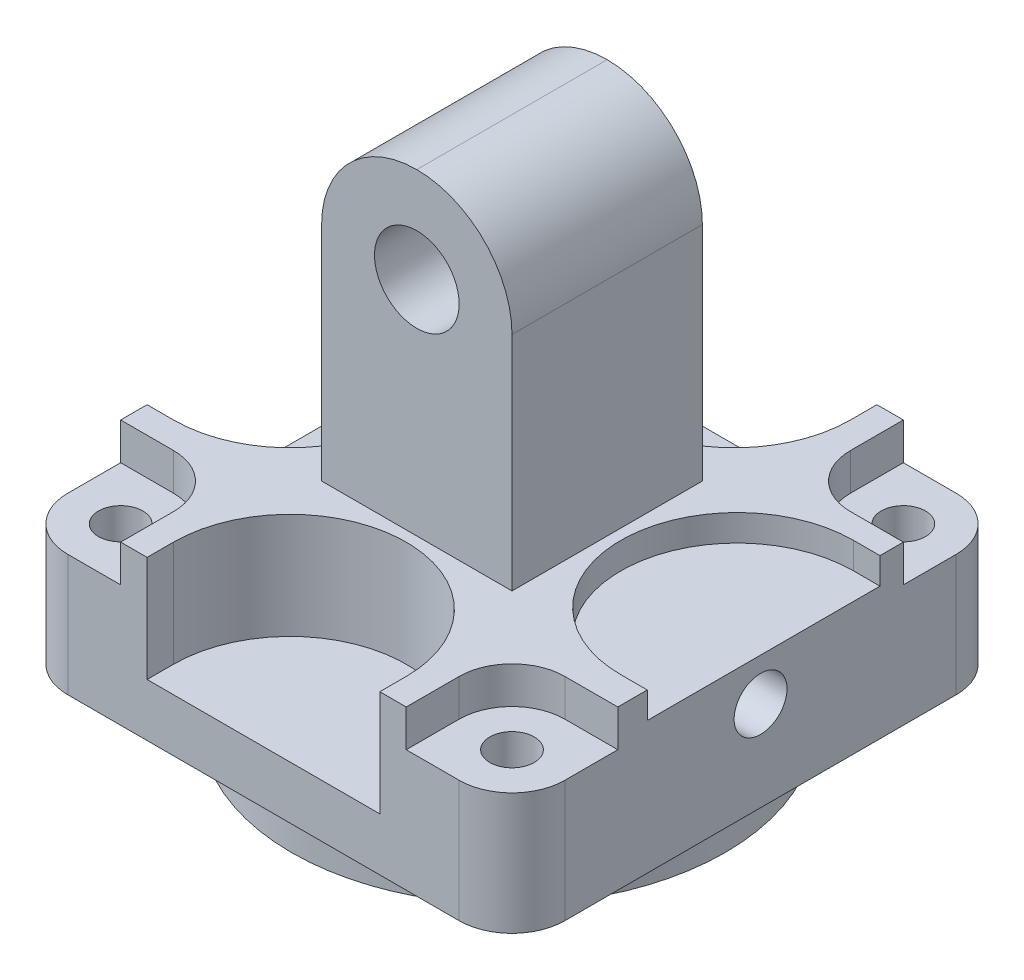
ISO-10303-21;
HEADER;
FILE_DESCRIPTION(('STEP AP214'),'2;1');
FILE_NAME('part.step','',(''),(''),'','','');
FILE_SCHEMA(('AUTOMOTIVE_DESIGN { 1 0 10303 214 1 1 1 1 }'));
ENDSEC;
DATA;
#1=APPLICATION_CONTEXT('core data for automotive mechanical design processes');
#2=APPLICATION_PROTOCOL_DEFINITION('international standard','automotive_design',2000,#1);
#3=PRODUCT_CONTEXT('',#1,'mechanical');
#4=PRODUCT('Part','Part','',(#3));
#5=PRODUCT_RELATED_PRODUCT_CATEGORY('part','',(#4));
#6=PRODUCT_DEFINITION_FORMATION('','',#4);
#7=PRODUCT_DEFINITION_CONTEXT('part definition',#1,'design');
#8=PRODUCT_DEFINITION('design','',#6,#7);
#9=PRODUCT_DEFINITION_SHAPE('','',#8);
#10=(LENGTH_UNIT() NAMED_UNIT(*) SI_UNIT(.MILLI.,.METRE.));
#11=(NAMED_UNIT(*) PLANE_ANGLE_UNIT() SI_UNIT($,.RADIAN.));
#12=(NAMED_UNIT(*) SI_UNIT($,.STERADIAN.) SOLID_ANGLE_UNIT());
#13=UNCERTAINTY_MEASURE_WITH_UNIT(LENGTH_MEASURE(1.E-05),#10,'distance_accuracy_value','');
#14=(GEOMETRIC_REPRESENTATION_CONTEXT(3) GLOBAL_UNCERTAINTY_ASSIGNED_CONTEXT((#13)) GLOBAL_UNIT_ASSIGNED_CONTEXT((#10,
#11,#12)) REPRESENTATION_CONTEXT('',''));
#15=CARTESIAN_POINT('',(0.,0.,0.));
#16=DIRECTION('',(0.,0.,1.));
#17=DIRECTION('',(1.,0.,0.));
#18=AXIS2_PLACEMENT_3D('',#15,#16,#17);
#19=CARTESIAN_POINT('',(-23.5,15.,47.));
#20=DIRECTION('',(0.,-1.,0.));
#21=DIRECTION('',(0.,0.,-1.));
#22=AXIS2_PLACEMENT_3D('',#19,#20,#21);
#23=PLANE('',#22);
#24=CARTESIAN_POINT('',(-18.5,15.,5.));
#25=DIRECTION('',(0.,1.,0.));
#26=DIRECTION('',(0.,0.,1.));
#27=AXIS2_PLACEMENT_3D('',#24,#25,#26);
#28=CIRCLE('',#27,5.);
#29=CARTESIAN_POINT('',(-18.5,15.,10.));
#30=VERTEX_POINT('',#29);
#31=CARTESIAN_POINT('',(-13.5,15.,5.));
#32=VERTEX_POINT('',#31);
#33=EDGE_CURVE('E360',#30,#32,#28,.T.);
#34=ORIENTED_EDGE('',*,*,#33,.F.);
#35=DIRECTION('',(1.,0.,0.));
#36=VECTOR('',#35,1.);
#37=CARTESIAN_POINT('',(-18.5,15.,10.));
#38=LINE('',#37,#36);
#39=CARTESIAN_POINT('',(-23.5,15.,10.));
#40=VERTEX_POINT('',#39);
#41=EDGE_CURVE('E365',#40,#30,#38,.T.);
#42=ORIENTED_EDGE('',*,*,#41,.F.);
#43=DIRECTION('',(0.,0.,-1.));
#44=VECTOR('',#43,1.);
#45=CARTESIAN_POINT('',(-23.5,15.,47.));
#46=LINE('',#45,#44);
#47=CARTESIAN_POINT('',(-23.5,15.,12.5));
#48=VERTEX_POINT('',#47);
#49=EDGE_CURVE('E646',#48,#40,#46,.T.);
#50=ORIENTED_EDGE('',*,*,#49,.F.);
#51=DIRECTION('',(-1.,0.,0.));
#52=VECTOR('',#51,1.);
#53=CARTESIAN_POINT('',(-21.,15.,12.5));
#54=LINE('',#53,#52);
#55=CARTESIAN_POINT('',(-21.,15.,12.5));
#56=VERTEX_POINT('',#55);
#57=EDGE_CURVE('E587',#56,#48,#54,.T.);
#58=ORIENTED_EDGE('',*,*,#57,.F.);
#59=CARTESIAN_POINT('',(-21.,15.,23.5));
#60=DIRECTION('',(0.,1.,0.));
#61=DIRECTION('',(0.,0.,1.));
#62=AXIS2_PLACEMENT_3D('',#59,#60,#61);
#63=CIRCLE('',#62,11.);
#64=CARTESIAN_POINT('',(-21.,15.,34.5));
#65=VERTEX_POINT('',#64);
#66=EDGE_CURVE('E565',#65,#56,#63,.T.);
#67=ORIENTED_EDGE('',*,*,#66,.F.);
#68=DIRECTION('',(1.,0.,0.));
#69=VECTOR('',#68,1.);
#70=CARTESIAN_POINT('',(-21.,15.,34.5));
#71=LINE('',#70,#69);
#72=CARTESIAN_POINT('',(-23.5,15.,34.5));
#73=VERTEX_POINT('',#72);
#74=EDGE_CURVE('E577',#73,#65,#71,.T.);
#75=ORIENTED_EDGE('',*,*,#74,.F.);
#76=CARTESIAN_POINT('',(-23.5,15.,37.));
#77=VERTEX_POINT('',#76);
#78=EDGE_CURVE('E651',#77,#73,#46,.T.);
#79=ORIENTED_EDGE('',*,*,#78,.F.);
#80=DIRECTION('',(-1.,0.,0.));
#81=VECTOR('',#80,1.);
#82=CARTESIAN_POINT('',(-18.5,15.,37.));
#83=LINE('',#82,#81);
#84=CARTESIAN_POINT('',(-18.5,15.,37.));
#85=VERTEX_POINT('',#84);
#86=EDGE_CURVE('E446',#85,#77,#83,.T.);
#87=ORIENTED_EDGE('',*,*,#86,.F.);
#88=CARTESIAN_POINT('',(-18.5,15.,42.));
#89=DIRECTION('',(0.,1.,0.));
#90=DIRECTION('',(0.,0.,1.));
#91=AXIS2_PLACEMENT_3D('',#88,#89,#90);
#92=CIRCLE('',#91,5.);
#93=CARTESIAN_POINT('',(-13.5,15.,42.));
#94=VERTEX_POINT('',#93);
#95=EDGE_CURVE('E443',#94,#85,#92,.T.);
#96=ORIENTED_EDGE('',*,*,#95,.F.);
#97=DIRECTION('',(0.,0.,-1.));
#98=VECTOR('',#97,1.);
#99=CARTESIAN_POINT('',(-13.5,15.,42.));
#100=LINE('',#99,#98);
#101=CARTESIAN_POINT('',(-13.5,15.,47.));
#102=VERTEX_POINT('',#101);
#103=EDGE_CURVE('E430',#102,#94,#100,.T.);
#104=ORIENTED_EDGE('',*,*,#103,.F.);
#105=DIRECTION('',(-1.,0.,0.));
#106=VECTOR('',#105,1.);
#107=CARTESIAN_POINT('',(-23.5,15.,47.));
#108=LINE('',#107,#106);
#109=CARTESIAN_POINT('',(-11.,15.,47.));
#110=VERTEX_POINT('',#109);
#111=EDGE_CURVE('E642',#110,#102,#108,.T.);
#112=ORIENTED_EDGE('',*,*,#111,.F.);
#113=DIRECTION('',(0.,0.,1.));
#114=VECTOR('',#113,1.);
#115=CARTESIAN_POINT('',(-11.,15.,47.));
#116=LINE('',#115,#114);
#117=CARTESIAN_POINT('',(-11.,15.,44.5));
#118=VERTEX_POINT('',#117);
#119=EDGE_CURVE('E559',#118,#110,#116,.T.);
#120=ORIENTED_EDGE('',*,*,#119,.F.);
#121=CARTESIAN_POINT('',(0.,15.,44.5));
#122=DIRECTION('',(0.,1.,0.));
#123=DIRECTION('',(0.,0.,1.));
#124=AXIS2_PLACEMENT_3D('',#121,#122,#123);
#125=CIRCLE('',#124,11.);
#126=CARTESIAN_POINT('',(11.,15.,44.5));
#127=VERTEX_POINT('',#126);
#128=EDGE_CURVE('E537',#127,#118,#125,.T.);
#129=ORIENTED_EDGE('',*,*,#128,.F.);
#130=DIRECTION('',(0.,0.,-1.));
#131=VECTOR('',#130,1.);
#132=CARTESIAN_POINT('',(11.,15.,44.5));
#133=LINE('',#132,#131);
#134=CARTESIAN_POINT('',(11.,15.,47.));
#135=VERTEX_POINT('',#134);
#136=EDGE_CURVE('E549',#135,#127,#133,.T.);
#137=ORIENTED_EDGE('',*,*,#136,.F.);
#138=CARTESIAN_POINT('',(13.5,15.,47.));
#139=VERTEX_POINT('',#138);
#140=EDGE_CURVE('E644',#139,#135,#108,.T.);
#141=ORIENTED_EDGE('',*,*,#140,.F.);
#142=DIRECTION('',(0.,0.,1.));
#143=VECTOR('',#142,1.);
#144=CARTESIAN_POINT('',(13.5,15.,42.));
#145=LINE('',#144,#143);
#146=CARTESIAN_POINT('',(13.5,15.,42.));
#147=VERTEX_POINT('',#146);
#148=EDGE_CURVE('E479',#147,#139,#145,.T.);
#149=ORIENTED_EDGE('',*,*,#148,.F.);
#150=CARTESIAN_POINT('',(18.5,15.,42.));
#151=DIRECTION('',(0.,1.,0.));
#152=DIRECTION('',(0.,0.,1.));
#153=AXIS2_PLACEMENT_3D('',#150,#151,#152);
#154=CIRCLE('',#153,5.);
#155=CARTESIAN_POINT('',(18.5,15.,37.));
#156=VERTEX_POINT('',#155);
#157=EDGE_CURVE('E476',#156,#147,#154,.T.);
#158=ORIENTED_EDGE('',*,*,#157,.F.);
#159=DIRECTION('',(-1.,0.,0.));
#160=VECTOR('',#159,1.);
#161=CARTESIAN_POINT('',(18.5,15.,37.));
#162=LINE('',#161,#160);
#163=CARTESIAN_POINT('',(23.5,15.,37.));
#164=VERTEX_POINT('',#163);
#165=EDGE_CURVE('E463',#164,#156,#162,.T.);
#166=ORIENTED_EDGE('',*,*,#165,.F.);
#167=DIRECTION('',(0.,0.,-1.));
#168=VECTOR('',#167,1.);
#169=CARTESIAN_POINT('',(23.5,15.,47.));
#170=LINE('',#169,#168);
#171=CARTESIAN_POINT('',(23.5,15.,34.2115152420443));
#172=VERTEX_POINT('',#171);
#173=EDGE_CURVE('E654',#164,#172,#170,.T.);
#174=ORIENTED_EDGE('',*,*,#173,.T.);
#175=DIRECTION('',(1.,0.,0.));
#176=VECTOR('',#175,1.);
#177=CARTESIAN_POINT('',(20.9980183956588,15.,34.2115152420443));
#178=LINE('',#177,#176);
#179=CARTESIAN_POINT('',(20.9980183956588,15.,34.2115152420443));
#180=VERTEX_POINT('',#179);
#181=EDGE_CURVE('E530',#180,#172,#178,.T.);
#182=ORIENTED_EDGE('',*,*,#181,.F.);
#183=CARTESIAN_POINT('',(20.9980183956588,15.,23.2115152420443));
#184=DIRECTION('',(0.,1.,0.));
#185=DIRECTION('',(0.,0.,1.));
#186=AXIS2_PLACEMENT_3D('',#183,#184,#185);
#187=CIRCLE('',#186,11.);
#188=CARTESIAN_POINT('',(20.9980183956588,15.,12.2115152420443));
#189=VERTEX_POINT('',#188);
#190=EDGE_CURVE('E515',#189,#180,#187,.T.);
#191=ORIENTED_EDGE('',*,*,#190,.F.);
#192=DIRECTION('',(-1.,0.,0.));
#193=VECTOR('',#192,1.);
#194=CARTESIAN_POINT('',(20.9980183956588,15.,12.2115152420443));
#195=LINE('',#194,#193);
#196=CARTESIAN_POINT('',(23.5,15.,12.2115152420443));
#197=VERTEX_POINT('',#196);
#198=EDGE_CURVE('E520',#197,#189,#195,.T.);
#199=ORIENTED_EDGE('',*,*,#198,.F.);
#200=CARTESIAN_POINT('',(23.5,15.,10.));
#201=VERTEX_POINT('',#200);
#202=EDGE_CURVE('E653',#197,#201,#170,.T.);
#203=ORIENTED_EDGE('',*,*,#202,.T.);
#204=DIRECTION('',(1.,0.,0.));
#205=VECTOR('',#204,1.);
#206=CARTESIAN_POINT('',(18.5,15.,10.));
#207=LINE('',#206,#205);
#208=CARTESIAN_POINT('',(18.5,15.,10.));
#209=VERTEX_POINT('',#208);
#210=EDGE_CURVE('E413',#209,#201,#207,.T.);
#211=ORIENTED_EDGE('',*,*,#210,.F.);
#212=CARTESIAN_POINT('',(18.5,15.,5.));
#213=DIRECTION('',(0.,1.,0.));
#214=DIRECTION('',(0.,0.,1.));
#215=AXIS2_PLACEMENT_3D('',#212,#213,#214);
#216=CIRCLE('',#215,5.);
#217=CARTESIAN_POINT('',(13.5,15.,5.));
#218=VERTEX_POINT('',#217);
#219=EDGE_CURVE('E410',#218,#209,#216,.T.);
#220=ORIENTED_EDGE('',*,*,#219,.F.);
#221=DIRECTION('',(0.,0.,1.));
#222=VECTOR('',#221,1.);
#223=CARTESIAN_POINT('',(13.5,15.,5.));
#224=LINE('',#223,#222);
#225=CARTESIAN_POINT('',(13.5,15.,0.));
#226=VERTEX_POINT('',#225);
#227=EDGE_CURVE('E397',#226,#218,#224,.T.);
#228=ORIENTED_EDGE('',*,*,#227,.F.);
#229=DIRECTION('',(-1.,0.,0.));
#230=VECTOR('',#229,1.);
#231=CARTESIAN_POINT('',(-23.5,15.,0.));
#232=LINE('',#231,#230);
#233=CARTESIAN_POINT('',(11.,15.,0.));
#234=VERTEX_POINT('',#233);
#235=EDGE_CURVE('E643',#226,#234,#232,.T.);
#236=ORIENTED_EDGE('',*,*,#235,.T.);
#237=DIRECTION('',(0.,0.,-1.));
#238=VECTOR('',#237,1.);
#239=CARTESIAN_POINT('',(11.,15.,2.49999999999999));
#240=LINE('',#239,#238);
#241=CARTESIAN_POINT('',(11.,15.,2.49999999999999));
#242=VERTEX_POINT('',#241);
#243=EDGE_CURVE('E616',#242,#234,#240,.T.);
#244=ORIENTED_EDGE('',*,*,#243,.F.);
#245=CARTESIAN_POINT('',(0.,15.,2.5));
#246=DIRECTION('',(0.,1.,0.));
#247=DIRECTION('',(0.,0.,1.));
#248=AXIS2_PLACEMENT_3D('',#245,#246,#247);
#249=CIRCLE('',#248,11.);
#250=CARTESIAN_POINT('',(-11.,15.,2.49999999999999));
#251=VERTEX_POINT('',#250);
#252=EDGE_CURVE('E593',#251,#242,#249,.T.);
#253=ORIENTED_EDGE('',*,*,#252,.F.);
#254=DIRECTION('',(0.,0.,1.));
#255=VECTOR('',#254,1.);
#256=CARTESIAN_POINT('',(-11.,15.,2.49999999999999));
#257=LINE('',#256,#255);
#258=CARTESIAN_POINT('',(-11.,15.,0.));
#259=VERTEX_POINT('',#258);
#260=EDGE_CURVE('E606',#259,#251,#257,.T.);
#261=ORIENTED_EDGE('',*,*,#260,.F.);
#262=CARTESIAN_POINT('',(-13.5,15.,0.));
#263=VERTEX_POINT('',#262);
#264=EDGE_CURVE('E649',#259,#263,#232,.T.);
#265=ORIENTED_EDGE('',*,*,#264,.T.);
#266=DIRECTION('',(0.,0.,-1.));
#267=VECTOR('',#266,1.);
#268=CARTESIAN_POINT('',(-13.5,15.,5.));
#269=LINE('',#268,#267);
#270=EDGE_CURVE('E380',#32,#263,#269,.T.);
#271=ORIENTED_EDGE('',*,*,#270,.F.);
#272=EDGE_LOOP('',(#34,#42,#50,#58,#67,#75,#79,#87,#96,#104,#112,#120,#129,#137,#141,#149,#158,
#166,#174,#182,#191,#199,#203,#211,#220,#228,#236,#244,#253,#261,#265,#271));
#273=FACE_BOUND('',#272,.T.);
#274=DIRECTION('',(0.,0.,1.));
#275=VECTOR('',#274,1.);
#276=CARTESIAN_POINT('',(-9.,15.,14.5));
#277=LINE('',#276,#275);
#278=CARTESIAN_POINT('',(-9.,15.,14.5));
#279=VERTEX_POINT('',#278);
#280=CARTESIAN_POINT('',(-9.,15.,32.5));
#281=VERTEX_POINT('',#280);
#282=EDGE_CURVE('E331',#279,#281,#277,.T.);
#283=ORIENTED_EDGE('',*,*,#282,.F.);
#284=DIRECTION('',(-1.,0.,0.));
#285=VECTOR('',#284,1.);
#286=CARTESIAN_POINT('',(-9.,15.,14.5));
#287=LINE('',#286,#285);
#288=CARTESIAN_POINT('',(9.,15.,14.5));
#289=VERTEX_POINT('',#288);
#290=EDGE_CURVE('E337',#289,#279,#287,.T.);
#291=ORIENTED_EDGE('',*,*,#290,.F.);
#292=DIRECTION('',(0.,0.,-1.));
#293=VECTOR('',#292,1.);
#294=CARTESIAN_POINT('',(9.,15.,14.5));
#295=LINE('',#294,#293);
#296=CARTESIAN_POINT('',(9.00000000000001,15.,32.5));
#297=VERTEX_POINT('',#296);
#298=EDGE_CURVE('E350',#297,#289,#295,.T.);
#299=ORIENTED_EDGE('',*,*,#298,.F.);
#300=DIRECTION('',(1.,0.,0.));
#301=VECTOR('',#300,1.);
#302=CARTESIAN_POINT('',(-9.,15.,32.5));
#303=LINE('',#302,#301);
#304=EDGE_CURVE('E345',#281,#297,#303,.T.);
#305=ORIENTED_EDGE('',*,*,#304,.F.);
#306=EDGE_LOOP('',(#283,#291,#299,#305));
#307=FACE_BOUND('',#306,.T.);
#308=ADVANCED_FACE('F37',(#273,#307),#23,.F.);
#309=CARTESIAN_POINT('',(-18.5,15.,5.));
#310=DIRECTION('',(0.,-1.,0.));
#311=DIRECTION('',(0.,0.,-1.));
#312=AXIS2_PLACEMENT_3D('',#309,#310,#311);
#313=CYLINDRICAL_SURFACE('',#312,5.);
#314=DIRECTION('',(0.,-1.,0.));
#315=VECTOR('',#314,1.);
#316=CARTESIAN_POINT('',(-23.5,15.,5.));
#317=LINE('',#316,#315);
#318=CARTESIAN_POINT('',(-23.5,11.5,5.));
#319=VERTEX_POINT('',#318);
#320=CARTESIAN_POINT('',(-23.5,0.,5.));
#321=VERTEX_POINT('',#320);
#322=EDGE_CURVE('E678',#319,#321,#317,.T.);
#323=ORIENTED_EDGE('',*,*,#322,.F.);
#324=CARTESIAN_POINT('',(-18.5,11.5,5.));
#325=DIRECTION('',(0.,1.,0.));
#326=DIRECTION('',(0.,0.,1.));
#327=AXIS2_PLACEMENT_3D('',#324,#325,#326);
#328=CIRCLE('',#327,5.);
#329=CARTESIAN_POINT('',(-18.5,11.5,0.));
#330=VERTEX_POINT('',#329);
#331=EDGE_CURVE('E370',#330,#319,#328,.T.);
#332=ORIENTED_EDGE('',*,*,#331,.F.);
#333=DIRECTION('',(0.,-1.,0.));
#334=VECTOR('',#333,1.);
#335=CARTESIAN_POINT('',(-18.5,0.,0.));
#336=LINE('',#335,#334);
#337=CARTESIAN_POINT('',(-18.5,0.,0.));
#338=VERTEX_POINT('',#337);
#339=EDGE_CURVE('E688',#338,#330,#336,.F.);
#340=ORIENTED_EDGE('',*,*,#339,.F.);
#341=CARTESIAN_POINT('',(-18.5,0.,5.));
#342=DIRECTION('',(0.,1.,0.));
#343=DIRECTION('',(0.,0.,1.));
#344=AXIS2_PLACEMENT_3D('',#341,#342,#343);
#345=CIRCLE('',#344,5.);
#346=EDGE_CURVE('E670',#321,#338,#345,.F.);
#347=ORIENTED_EDGE('',*,*,#346,.F.);
#348=EDGE_LOOP('',(#323,#332,#340,#347));
#349=FACE_BOUND('',#348,.T.);
#350=ADVANCED_FACE('F729',(#349),#313,.T.);
#351=CARTESIAN_POINT('',(-18.5,-8.5,5.));
#352=DIRECTION('',(0.,1.,0.));
#353=DIRECTION('',(0.,0.,1.));
#354=AXIS2_PLACEMENT_3D('',#351,#352,#353);
#355=CYLINDRICAL_SURFACE('',#354,2.1);
#356=CARTESIAN_POINT('',(-18.5,0.,5.));
#357=DIRECTION('',(0.,1.,0.));
#358=DIRECTION('',(0.,0.,1.));
#359=AXIS2_PLACEMENT_3D('',#356,#357,#358);
#360=CIRCLE('',#359,2.1);
#361=CARTESIAN_POINT('',(-18.5,0.,7.09999999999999));
#362=VERTEX_POINT('',#361);
#363=EDGE_CURVE('E503',#362,#362,#360,.T.);
#364=ORIENTED_EDGE('',*,*,#363,.F.);
#365=EDGE_LOOP('',(#364));
#366=FACE_BOUND('',#365,.T.);
#367=CARTESIAN_POINT('',(-18.5,11.5,5.));
#368=DIRECTION('',(0.,1.,0.));
#369=DIRECTION('',(0.,0.,1.));
#370=AXIS2_PLACEMENT_3D('',#367,#368,#369);
#371=CIRCLE('',#370,2.1);
#372=CARTESIAN_POINT('',(-18.5,11.5,7.09999999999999));
#373=VERTEX_POINT('',#372);
#374=EDGE_CURVE('E386',#373,#373,#371,.F.);
#375=ORIENTED_EDGE('',*,*,#374,.F.);
#376=EDGE_LOOP('',(#375));
#377=FACE_BOUND('',#376,.T.);
#378=ADVANCED_FACE('F735',(#366,#377),#355,.F.);
#379=CARTESIAN_POINT('',(18.5,15.,5.));
#380=DIRECTION('',(0.,1.,0.));
#381=DIRECTION('',(-1.,0.,0.));
#382=AXIS2_PLACEMENT_3D('',#379,#380,#381);
#383=CYLINDRICAL_SURFACE('',#382,5.);
#384=DIRECTION('',(0.,1.,0.));
#385=VECTOR('',#384,1.);
#386=CARTESIAN_POINT('',(18.5,0.,0.));
#387=LINE('',#386,#385);
#388=CARTESIAN_POINT('',(18.5,11.5,0.));
#389=VERTEX_POINT('',#388);
#390=CARTESIAN_POINT('',(18.5,0.,0.));
#391=VERTEX_POINT('',#390);
#392=EDGE_CURVE('E691',#389,#391,#387,.F.);
#393=ORIENTED_EDGE('',*,*,#392,.F.);
#394=CARTESIAN_POINT('',(18.5,11.5,5.));
#395=DIRECTION('',(0.,1.,0.));
#396=DIRECTION('',(0.,0.,1.));
#397=AXIS2_PLACEMENT_3D('',#394,#395,#396);
#398=CIRCLE('',#397,5.);
#399=CARTESIAN_POINT('',(23.5,11.5,5.));
#400=VERTEX_POINT('',#399);
#401=EDGE_CURVE('E402',#400,#389,#398,.T.);
#402=ORIENTED_EDGE('',*,*,#401,.F.);
#403=DIRECTION('',(0.,1.,0.));
#404=VECTOR('',#403,1.);
#405=CARTESIAN_POINT('',(23.5,15.,5.));
#406=LINE('',#405,#404);
#407=CARTESIAN_POINT('',(23.5,0.,5.));
#408=VERTEX_POINT('',#407);
#409=EDGE_CURVE('E683',#408,#400,#406,.T.);
#410=ORIENTED_EDGE('',*,*,#409,.F.);
#411=CARTESIAN_POINT('',(18.5,0.,5.));
#412=DIRECTION('',(0.,1.,0.));
#413=DIRECTION('',(0.,0.,1.));
#414=AXIS2_PLACEMENT_3D('',#411,#412,#413);
#415=CIRCLE('',#414,5.);
#416=EDGE_CURVE('E672',#391,#408,#415,.F.);
#417=ORIENTED_EDGE('',*,*,#416,.F.);
#418=EDGE_LOOP('',(#393,#402,#410,#417));
#419=FACE_BOUND('',#418,.T.);
#420=ADVANCED_FACE('F768',(#419),#383,.T.);
#421=CARTESIAN_POINT('',(18.5,-8.5,5.));
#422=DIRECTION('',(0.,1.,0.));
#423=DIRECTION('',(0.,0.,1.));
#424=AXIS2_PLACEMENT_3D('',#421,#422,#423);
#425=CYLINDRICAL_SURFACE('',#424,2.1);
#426=CARTESIAN_POINT('',(18.5,0.,5.));
#427=DIRECTION('',(0.,1.,0.));
#428=DIRECTION('',(0.,0.,1.));
#429=AXIS2_PLACEMENT_3D('',#426,#427,#428);
#430=CIRCLE('',#429,2.1);
#431=CARTESIAN_POINT('',(18.5,0.,7.09999999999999));
#432=VERTEX_POINT('',#431);
#433=EDGE_CURVE('E512',#432,#432,#430,.T.);
#434=ORIENTED_EDGE('',*,*,#433,.F.);
#435=EDGE_LOOP('',(#434));
#436=FACE_BOUND('',#435,.T.);
#437=CARTESIAN_POINT('',(18.5,11.5,5.));
#438=DIRECTION('',(0.,1.,0.));
#439=DIRECTION('',(0.,0.,1.));
#440=AXIS2_PLACEMENT_3D('',#437,#438,#439);
#441=CIRCLE('',#440,2.1);
#442=CARTESIAN_POINT('',(18.5,11.5,7.09999999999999));
#443=VERTEX_POINT('',#442);
#444=EDGE_CURVE('E419',#443,#443,#441,.F.);
#445=ORIENTED_EDGE('',*,*,#444,.F.);
#446=EDGE_LOOP('',(#445));
#447=FACE_BOUND('',#446,.T.);
#448=ADVANCED_FACE('F761',(#436,#447),#425,.F.);
#449=CARTESIAN_POINT('',(-18.5,0.,42.));
#450=DIRECTION('',(0.,1.,0.));
#451=DIRECTION('',(0.,0.,1.));
#452=AXIS2_PLACEMENT_3D('',#449,#450,#451);
#453=CYLINDRICAL_SURFACE('',#452,5.);
#454=DIRECTION('',(0.,-1.,0.));
#455=VECTOR('',#454,1.);
#456=CARTESIAN_POINT('',(-18.5,0.,47.));
#457=LINE('',#456,#455);
#458=CARTESIAN_POINT('',(-18.5,11.5,47.));
#459=VERTEX_POINT('',#458);
#460=CARTESIAN_POINT('',(-18.5,0.,47.));
#461=VERTEX_POINT('',#460);
#462=EDGE_CURVE('E668',#459,#461,#457,.T.);
#463=ORIENTED_EDGE('',*,*,#462,.F.);
#464=CARTESIAN_POINT('',(-18.5,11.5,42.));
#465=DIRECTION('',(0.,1.,0.));
#466=DIRECTION('',(0.,0.,1.));
#467=AXIS2_PLACEMENT_3D('',#464,#465,#466);
#468=CIRCLE('',#467,5.);
#469=CARTESIAN_POINT('',(-23.5,11.5,42.));
#470=VERTEX_POINT('',#469);
#471=EDGE_CURVE('E435',#470,#459,#468,.T.);
#472=ORIENTED_EDGE('',*,*,#471,.F.);
#473=DIRECTION('',(0.,-1.,0.));
#474=VECTOR('',#473,1.);
#475=CARTESIAN_POINT('',(-23.5,15.,42.));
#476=LINE('',#475,#474);
#477=CARTESIAN_POINT('',(-23.5,0.,42.));
#478=VERTEX_POINT('',#477);
#479=EDGE_CURVE('E680',#478,#470,#476,.F.);
#480=ORIENTED_EDGE('',*,*,#479,.F.);
#481=CARTESIAN_POINT('',(-18.5,0.,42.));
#482=DIRECTION('',(0.,1.,0.));
#483=DIRECTION('',(0.,0.,1.));
#484=AXIS2_PLACEMENT_3D('',#481,#482,#483);
#485=CIRCLE('',#484,5.);
#486=EDGE_CURVE('E676',#461,#478,#485,.F.);
#487=ORIENTED_EDGE('',*,*,#486,.F.);
#488=EDGE_LOOP('',(#463,#472,#480,#487));
#489=FACE_BOUND('',#488,.T.);
#490=ADVANCED_FACE('F757',(#489),#453,.T.);
#491=CARTESIAN_POINT('',(-18.5,-8.5,42.));
#492=DIRECTION('',(0.,1.,0.));
#493=DIRECTION('',(0.,0.,1.));
#494=AXIS2_PLACEMENT_3D('',#491,#492,#493);
#495=CYLINDRICAL_SURFACE('',#494,2.09999999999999);
#496=CARTESIAN_POINT('',(-18.5,0.,42.));
#497=DIRECTION('',(0.,1.,0.));
#498=DIRECTION('',(0.,0.,1.));
#499=AXIS2_PLACEMENT_3D('',#496,#497,#498);
#500=CIRCLE('',#499,2.09999999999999);
#501=CARTESIAN_POINT('',(-18.5,0.,44.1));
#502=VERTEX_POINT('',#501);
#503=EDGE_CURVE('E506',#502,#502,#500,.T.);
#504=ORIENTED_EDGE('',*,*,#503,.F.);
#505=EDGE_LOOP('',(#504));
#506=FACE_BOUND('',#505,.T.);
#507=CARTESIAN_POINT('',(-18.5,11.5,42.));
#508=DIRECTION('',(0.,1.,0.));
#509=DIRECTION('',(0.,0.,1.));
#510=AXIS2_PLACEMENT_3D('',#507,#508,#509);
#511=CIRCLE('',#510,2.09999999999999);
#512=CARTESIAN_POINT('',(-18.5,11.5,44.1));
#513=VERTEX_POINT('',#512);
#514=EDGE_CURVE('E452',#513,#513,#511,.F.);
#515=ORIENTED_EDGE('',*,*,#514,.F.);
#516=EDGE_LOOP('',(#515));
#517=FACE_BOUND('',#516,.T.);
#518=ADVANCED_FACE('F760',(#506,#517),#495,.F.);
#519=CARTESIAN_POINT('',(18.5,0.,42.));
#520=DIRECTION('',(0.,-1.,0.));
#521=DIRECTION('',(1.,0.,0.));
#522=AXIS2_PLACEMENT_3D('',#519,#520,#521);
#523=CYLINDRICAL_SURFACE('',#522,5.);
#524=DIRECTION('',(0.,1.,0.));
#525=VECTOR('',#524,1.);
#526=CARTESIAN_POINT('',(23.5,0.,42.));
#527=LINE('',#526,#525);
#528=CARTESIAN_POINT('',(23.5,11.5,42.));
#529=VERTEX_POINT('',#528);
#530=CARTESIAN_POINT('',(23.5,0.,42.));
#531=VERTEX_POINT('',#530);
#532=EDGE_CURVE('E686',#529,#531,#527,.F.);
#533=ORIENTED_EDGE('',*,*,#532,.F.);
#534=CARTESIAN_POINT('',(18.5,11.5,42.));
#535=DIRECTION('',(0.,1.,0.));
#536=DIRECTION('',(0.,0.,1.));
#537=AXIS2_PLACEMENT_3D('',#534,#535,#536);
#538=CIRCLE('',#537,5.);
#539=CARTESIAN_POINT('',(18.5,11.5,47.));
#540=VERTEX_POINT('',#539);
#541=EDGE_CURVE('E468',#540,#529,#538,.T.);
#542=ORIENTED_EDGE('',*,*,#541,.F.);
#543=DIRECTION('',(0.,1.,0.));
#544=VECTOR('',#543,1.);
#545=CARTESIAN_POINT('',(18.5,15.,47.));
#546=LINE('',#545,#544);
#547=CARTESIAN_POINT('',(18.5,0.,47.));
#548=VERTEX_POINT('',#547);
#549=EDGE_CURVE('E665',#548,#540,#546,.T.);
#550=ORIENTED_EDGE('',*,*,#549,.F.);
#551=CARTESIAN_POINT('',(18.5,0.,42.));
#552=DIRECTION('',(0.,1.,0.));
#553=DIRECTION('',(0.,0.,1.));
#554=AXIS2_PLACEMENT_3D('',#551,#552,#553);
#555=CIRCLE('',#554,5.);
#556=EDGE_CURVE('E674',#531,#548,#555,.F.);
#557=ORIENTED_EDGE('',*,*,#556,.F.);
#558=EDGE_LOOP('',(#533,#542,#550,#557));
#559=FACE_BOUND('',#558,.T.);
#560=ADVANCED_FACE('F763',(#559),#523,.T.);
#561=CARTESIAN_POINT('',(18.5,-8.5,42.));
#562=DIRECTION('',(0.,1.,0.));
#563=DIRECTION('',(0.,0.,1.));
#564=AXIS2_PLACEMENT_3D('',#561,#562,#563);
#565=CYLINDRICAL_SURFACE('',#564,2.09999999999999);
#566=CARTESIAN_POINT('',(18.5,0.,42.));
#567=DIRECTION('',(0.,1.,0.));
#568=DIRECTION('',(0.,0.,1.));
#569=AXIS2_PLACEMENT_3D('',#566,#567,#568);
#570=CIRCLE('',#569,2.09999999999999);
#571=CARTESIAN_POINT('',(18.5,0.,44.1));
#572=VERTEX_POINT('',#571);
#573=EDGE_CURVE('E509',#572,#572,#570,.T.);
#574=ORIENTED_EDGE('',*,*,#573,.F.);
#575=EDGE_LOOP('',(#574));
#576=FACE_BOUND('',#575,.T.);
#577=CARTESIAN_POINT('',(18.5,11.5,42.));
#578=DIRECTION('',(0.,1.,0.));
#579=DIRECTION('',(0.,0.,1.));
#580=AXIS2_PLACEMENT_3D('',#577,#578,#579);
#581=CIRCLE('',#580,2.09999999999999);
#582=CARTESIAN_POINT('',(18.5,11.5,44.1));
#583=VERTEX_POINT('',#582);
#584=EDGE_CURVE('E485',#583,#583,#581,.F.);
#585=ORIENTED_EDGE('',*,*,#584,.F.);
#586=EDGE_LOOP('',(#585));
#587=FACE_BOUND('',#586,.T.);
#588=ADVANCED_FACE('F766',(#576,#587),#565,.F.);
#589=CARTESIAN_POINT('',(0.,-5.,23.8472881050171));
#590=DIRECTION('',(0.,-1.,0.));
#591=DIRECTION('',(1.,0.,0.));
#592=AXIS2_PLACEMENT_3D('',#589,#590,#591);
#593=PLANE('',#592);
#594=CARTESIAN_POINT('',(0.,-5.,23.8472881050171));
#595=DIRECTION('',(0.,-1.,0.));
#596=DIRECTION('',(1.,0.,0.));
#597=AXIS2_PLACEMENT_3D('',#594,#595,#596);
#598=CIRCLE('',#597,20.5);
#599=CARTESIAN_POINT('',(20.5,-5.,23.8472881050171));
#600=VERTEX_POINT('',#599);
#601=EDGE_CURVE('E633',#600,#600,#598,.T.);
#602=ORIENTED_EDGE('',*,*,#601,.T.);
#603=EDGE_LOOP('',(#602));
#604=FACE_BOUND('',#603,.T.);
#605=CARTESIAN_POINT('',(0.,-5.,23.8472881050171));
#606=DIRECTION('',(0.,-1.,0.));
#607=DIRECTION('',(1.,0.,0.));
#608=AXIS2_PLACEMENT_3D('',#605,#606,#607);
#609=CIRCLE('',#608,9.75);
#610=CARTESIAN_POINT('',(9.75,-5.,23.8472881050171));
#611=VERTEX_POINT('',#610);
#612=EDGE_CURVE('E623',#611,#611,#609,.T.);
#613=ORIENTED_EDGE('',*,*,#612,.F.);
#614=EDGE_LOOP('',(#613));
#615=FACE_BOUND('',#614,.T.);
#616=ADVANCED_FACE('F752',(#604,#615),#593,.T.);
#617=CARTESIAN_POINT('',(-23.5,0.,47.));
#618=DIRECTION('',(0.,1.,0.));
#619=DIRECTION('',(0.,0.,1.));
#620=AXIS2_PLACEMENT_3D('',#617,#618,#619);
#621=PLANE('',#620);
#622=ORIENTED_EDGE('',*,*,#363,.T.);
#623=EDGE_LOOP('',(#622));
#624=FACE_BOUND('',#623,.T.);
#625=ORIENTED_EDGE('',*,*,#503,.T.);
#626=EDGE_LOOP('',(#625));
#627=FACE_BOUND('',#626,.T.);
#628=ORIENTED_EDGE('',*,*,#573,.T.);
#629=EDGE_LOOP('',(#628));
#630=FACE_BOUND('',#629,.T.);
#631=ORIENTED_EDGE('',*,*,#433,.T.);
#632=EDGE_LOOP('',(#631));
#633=FACE_BOUND('',#632,.T.);
#634=DIRECTION('',(1.,0.,0.));
#635=VECTOR('',#634,1.);
#636=CARTESIAN_POINT('',(-23.5,0.,47.));
#637=LINE('',#636,#635);
#638=EDGE_CURVE('E639',#461,#548,#637,.T.);
#639=ORIENTED_EDGE('',*,*,#638,.F.);
#640=ORIENTED_EDGE('',*,*,#486,.T.);
#641=DIRECTION('',(0.,0.,-1.));
#642=VECTOR('',#641,1.);
#643=CARTESIAN_POINT('',(-23.5,0.,47.));
#644=LINE('',#643,#642);
#645=EDGE_CURVE('E659',#478,#321,#644,.T.);
#646=ORIENTED_EDGE('',*,*,#645,.T.);
#647=ORIENTED_EDGE('',*,*,#346,.T.);
#648=DIRECTION('',(1.,0.,0.));
#649=VECTOR('',#648,1.);
#650=CARTESIAN_POINT('',(-23.5,0.,0.));
#651=LINE('',#650,#649);
#652=EDGE_CURVE('E638',#338,#391,#651,.T.);
#653=ORIENTED_EDGE('',*,*,#652,.T.);
#654=ORIENTED_EDGE('',*,*,#416,.T.);
#655=DIRECTION('',(0.,0.,-1.));
#656=VECTOR('',#655,1.);
#657=CARTESIAN_POINT('',(23.5,0.,47.));
#658=LINE('',#657,#656);
#659=EDGE_CURVE('E656',#531,#408,#658,.T.);
#660=ORIENTED_EDGE('',*,*,#659,.F.);
#661=ORIENTED_EDGE('',*,*,#556,.T.);
#662=EDGE_LOOP('',(#639,#640,#646,#647,#653,#654,#660,#661));
#663=FACE_BOUND('',#662,.T.);
#664=CARTESIAN_POINT('',(0.,0.,23.8472881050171));
#665=DIRECTION('',(0.,1.,0.));
#666=DIRECTION('',(0.,0.,1.));
#667=AXIS2_PLACEMENT_3D('',#664,#665,#666);
#668=CIRCLE('',#667,20.5);
#669=CARTESIAN_POINT('',(0.,0.,44.3472881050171));
#670=VERTEX_POINT('',#669);
#671=EDGE_CURVE('E662',#670,#670,#668,.F.);
#672=ORIENTED_EDGE('',*,*,#671,.F.);
#673=EDGE_LOOP('',(#672));
#674=FACE_BOUND('',#673,.T.);
#675=ADVANCED_FACE('F749',(#624,#627,#630,#633,#663,#674),#621,.F.);
#676=CARTESIAN_POINT('',(-23.5,15.,47.));
#677=DIRECTION('',(1.,0.,0.));
#678=DIRECTION('',(0.,0.,-1.));
#679=AXIS2_PLACEMENT_3D('',#676,#677,#678);
#680=PLANE('',#679);
#681=ORIENTED_EDGE('',*,*,#49,.T.);
#682=DIRECTION('',(0.,1.,0.));
#683=VECTOR('',#682,1.);
#684=CARTESIAN_POINT('',(-23.5,11.5,10.));
#685=LINE('',#684,#683);
#686=CARTESIAN_POINT('',(-23.5,11.5,10.));
#687=VERTEX_POINT('',#686);
#688=EDGE_CURVE('E387',#687,#40,#685,.T.);
#689=ORIENTED_EDGE('',*,*,#688,.F.);
#690=DIRECTION('',(0.,0.,1.));
#691=VECTOR('',#690,1.);
#692=CARTESIAN_POINT('',(-23.5,11.5,10.));
#693=LINE('',#692,#691);
#694=EDGE_CURVE('E372',#319,#687,#693,.T.);
#695=ORIENTED_EDGE('',*,*,#694,.F.);
#696=ORIENTED_EDGE('',*,*,#322,.T.);
#697=ORIENTED_EDGE('',*,*,#645,.F.);
#698=ORIENTED_EDGE('',*,*,#479,.T.);
#699=DIRECTION('',(0.,0.,1.));
#700=VECTOR('',#699,1.);
#701=CARTESIAN_POINT('',(-23.5,11.5,37.));
#702=LINE('',#701,#700);
#703=CARTESIAN_POINT('',(-23.5,11.5,37.));
#704=VERTEX_POINT('',#703);
#705=EDGE_CURVE('E433',#704,#470,#702,.T.);
#706=ORIENTED_EDGE('',*,*,#705,.F.);
#707=DIRECTION('',(0.,1.,0.));
#708=VECTOR('',#707,1.);
#709=CARTESIAN_POINT('',(-23.5,11.5,37.));
#710=LINE('',#709,#708);
#711=EDGE_CURVE('E455',#704,#77,#710,.T.);
#712=ORIENTED_EDGE('',*,*,#711,.T.);
#713=ORIENTED_EDGE('',*,*,#78,.T.);
#714=DIRECTION('',(0.,1.,0.));
#715=VECTOR('',#714,1.);
#716=CARTESIAN_POINT('',(-23.5,4.99999999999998,34.5));
#717=LINE('',#716,#715);
#718=CARTESIAN_POINT('',(-23.5,4.99999999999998,34.5));
#719=VERTEX_POINT('',#718);
#720=EDGE_CURVE('E594',#719,#73,#717,.T.);
#721=ORIENTED_EDGE('',*,*,#720,.F.);
#722=DIRECTION('',(0.,0.,1.));
#723=VECTOR('',#722,1.);
#724=CARTESIAN_POINT('',(-23.5,4.99999999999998,12.5));
#725=LINE('',#724,#723);
#726=CARTESIAN_POINT('',(-23.5,4.99999999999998,12.5));
#727=VERTEX_POINT('',#726);
#728=EDGE_CURVE('E580',#727,#719,#725,.T.);
#729=ORIENTED_EDGE('',*,*,#728,.F.);
#730=DIRECTION('',(0.,1.,0.));
#731=VECTOR('',#730,1.);
#732=CARTESIAN_POINT('',(-23.5,4.99999999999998,12.5));
#733=LINE('',#732,#731);
#734=EDGE_CURVE('E597',#727,#48,#733,.T.);
#735=ORIENTED_EDGE('',*,*,#734,.T.);
#736=EDGE_LOOP('',(#681,#689,#695,#696,#697,#698,#706,#712,#713,#721,#729,#735));
#737=FACE_BOUND('',#736,.T.);
#738=ADVANCED_FACE('F747',(#737),#680,.F.);
#739=CARTESIAN_POINT('',(23.5,15.,47.));
#740=DIRECTION('',(-1.,0.,0.));
#741=DIRECTION('',(0.,-1.,0.));
#742=AXIS2_PLACEMENT_3D('',#739,#740,#741);
#743=PLANE('',#742);
#744=CARTESIAN_POINT('',(23.5,8.5,23.5));
#745=DIRECTION('',(1.,0.,0.));
#746=DIRECTION('',(0.,0.,-1.));
#747=AXIS2_PLACEMENT_3D('',#744,#745,#746);
#748=CIRCLE('',#747,2.49999999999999);
#749=CARTESIAN_POINT('',(23.5,8.5,21.));
#750=VERTEX_POINT('',#749);
#751=EDGE_CURVE('E494',#750,#750,#748,.T.);
#752=ORIENTED_EDGE('',*,*,#751,.F.);
#753=EDGE_LOOP('',(#752));
#754=FACE_BOUND('',#753,.T.);
#755=DIRECTION('',(0.,0.,-1.));
#756=VECTOR('',#755,1.);
#757=CARTESIAN_POINT('',(23.5,11.5,10.));
#758=LINE('',#757,#756);
#759=CARTESIAN_POINT('',(23.5,11.5,10.));
#760=VERTEX_POINT('',#759);
#761=EDGE_CURVE('E400',#760,#400,#758,.T.);
#762=ORIENTED_EDGE('',*,*,#761,.F.);
#763=DIRECTION('',(0.,1.,0.));
#764=VECTOR('',#763,1.);
#765=CARTESIAN_POINT('',(23.5,11.5,10.));
#766=LINE('',#765,#764);
#767=EDGE_CURVE('E422',#760,#201,#766,.T.);
#768=ORIENTED_EDGE('',*,*,#767,.T.);
#769=ORIENTED_EDGE('',*,*,#202,.F.);
#770=DIRECTION('',(0.,1.,0.));
#771=VECTOR('',#770,1.);
#772=CARTESIAN_POINT('',(23.5,12.5,12.2115152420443));
#773=LINE('',#772,#771);
#774=CARTESIAN_POINT('',(23.5,12.5,12.2115152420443));
#775=VERTEX_POINT('',#774);
#776=EDGE_CURVE('E538',#775,#197,#773,.T.);
#777=ORIENTED_EDGE('',*,*,#776,.F.);
#778=DIRECTION('',(0.,0.,-1.));
#779=VECTOR('',#778,1.);
#780=CARTESIAN_POINT('',(23.5,12.5,12.2115152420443));
#781=LINE('',#780,#779);
#782=CARTESIAN_POINT('',(23.5,12.5,34.2115152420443));
#783=VERTEX_POINT('',#782);
#784=EDGE_CURVE('E523',#783,#775,#781,.T.);
#785=ORIENTED_EDGE('',*,*,#784,.F.);
#786=DIRECTION('',(0.,1.,0.));
#787=VECTOR('',#786,1.);
#788=CARTESIAN_POINT('',(23.5,12.5,34.2115152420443));
#789=LINE('',#788,#787);
#790=EDGE_CURVE('E540',#783,#172,#789,.T.);
#791=ORIENTED_EDGE('',*,*,#790,.T.);
#792=ORIENTED_EDGE('',*,*,#173,.F.);
#793=DIRECTION('',(0.,1.,0.));
#794=VECTOR('',#793,1.);
#795=CARTESIAN_POINT('',(23.5,11.5,37.));
#796=LINE('',#795,#794);
#797=CARTESIAN_POINT('',(23.5,11.5,37.));
#798=VERTEX_POINT('',#797);
#799=EDGE_CURVE('E486',#798,#164,#796,.T.);
#800=ORIENTED_EDGE('',*,*,#799,.F.);
#801=DIRECTION('',(0.,0.,-1.));
#802=VECTOR('',#801,1.);
#803=CARTESIAN_POINT('',(23.5,11.5,37.));
#804=LINE('',#803,#802);
#805=EDGE_CURVE('E470',#529,#798,#804,.T.);
#806=ORIENTED_EDGE('',*,*,#805,.F.);
#807=ORIENTED_EDGE('',*,*,#532,.T.);
#808=ORIENTED_EDGE('',*,*,#659,.T.);
#809=ORIENTED_EDGE('',*,*,#409,.T.);
#810=EDGE_LOOP('',(#762,#768,#769,#777,#785,#791,#792,#800,#806,#807,#808,#809));
#811=FACE_BOUND('',#810,.T.);
#812=ADVANCED_FACE('F743',(#754,#811),#743,.F.);
#813=CARTESIAN_POINT('',(-23.5,0.,47.));
#814=DIRECTION('',(0.,0.,1.));
#815=DIRECTION('',(1.,0.,0.));
#816=AXIS2_PLACEMENT_3D('',#813,#814,#815);
#817=PLANE('',#816);
#818=DIRECTION('',(0.,1.,0.));
#819=VECTOR('',#818,1.);
#820=CARTESIAN_POINT('',(-13.5,11.5,47.));
#821=LINE('',#820,#819);
#822=CARTESIAN_POINT('',(-13.5,11.5,47.));
#823=VERTEX_POINT('',#822);
#824=EDGE_CURVE('E453',#823,#102,#821,.T.);
#825=ORIENTED_EDGE('',*,*,#824,.F.);
#826=DIRECTION('',(1.,0.,0.));
#827=VECTOR('',#826,1.);
#828=CARTESIAN_POINT('',(-13.5,11.5,47.));
#829=LINE('',#828,#827);
#830=EDGE_CURVE('E437',#459,#823,#829,.T.);
#831=ORIENTED_EDGE('',*,*,#830,.F.);
#832=ORIENTED_EDGE('',*,*,#462,.T.);
#833=ORIENTED_EDGE('',*,*,#638,.T.);
#834=ORIENTED_EDGE('',*,*,#549,.T.);
#835=DIRECTION('',(1.,0.,0.));
#836=VECTOR('',#835,1.);
#837=CARTESIAN_POINT('',(13.5,11.5,47.));
#838=LINE('',#837,#836);
#839=CARTESIAN_POINT('',(13.5,11.5,47.));
#840=VERTEX_POINT('',#839);
#841=EDGE_CURVE('E466',#840,#540,#838,.T.);
#842=ORIENTED_EDGE('',*,*,#841,.F.);
#843=DIRECTION('',(0.,1.,0.));
#844=VECTOR('',#843,1.);
#845=CARTESIAN_POINT('',(13.5,11.5,47.));
#846=LINE('',#845,#844);
#847=EDGE_CURVE('E488',#840,#139,#846,.T.);
#848=ORIENTED_EDGE('',*,*,#847,.T.);
#849=ORIENTED_EDGE('',*,*,#140,.T.);
#850=DIRECTION('',(0.,1.,0.));
#851=VECTOR('',#850,1.);
#852=CARTESIAN_POINT('',(11.,4.99999999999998,47.));
#853=LINE('',#852,#851);
#854=CARTESIAN_POINT('',(11.,4.99999999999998,47.));
#855=VERTEX_POINT('',#854);
#856=EDGE_CURVE('E566',#855,#135,#853,.T.);
#857=ORIENTED_EDGE('',*,*,#856,.F.);
#858=DIRECTION('',(1.,0.,0.));
#859=VECTOR('',#858,1.);
#860=CARTESIAN_POINT('',(11.,4.99999999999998,47.));
#861=LINE('',#860,#859);
#862=CARTESIAN_POINT('',(-11.,4.99999999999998,47.));
#863=VERTEX_POINT('',#862);
#864=EDGE_CURVE('E551',#863,#855,#861,.T.);
#865=ORIENTED_EDGE('',*,*,#864,.F.);
#866=DIRECTION('',(0.,1.,0.));
#867=VECTOR('',#866,1.);
#868=CARTESIAN_POINT('',(-11.,4.99999999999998,47.));
#869=LINE('',#868,#867);
#870=EDGE_CURVE('E569',#863,#110,#869,.T.);
#871=ORIENTED_EDGE('',*,*,#870,.T.);
#872=ORIENTED_EDGE('',*,*,#111,.T.);
#873=EDGE_LOOP('',(#825,#831,#832,#833,#834,#842,#848,#849,#857,#865,#871,#872));
#874=FACE_BOUND('',#873,.T.);
#875=ADVANCED_FACE('F746',(#874),#817,.T.);
#876=CARTESIAN_POINT('',(-23.5,0.,0.));
#877=DIRECTION('',(0.,0.,1.));
#878=DIRECTION('',(1.,0.,0.));
#879=AXIS2_PLACEMENT_3D('',#876,#877,#878);
#880=PLANE('',#879);
#881=DIRECTION('',(-1.,0.,0.));
#882=VECTOR('',#881,1.);
#883=CARTESIAN_POINT('',(-13.5,11.5,0.));
#884=LINE('',#883,#882);
#885=CARTESIAN_POINT('',(-13.5,11.5,0.));
#886=VERTEX_POINT('',#885);
#887=EDGE_CURVE('E368',#886,#330,#884,.T.);
#888=ORIENTED_EDGE('',*,*,#887,.F.);
#889=DIRECTION('',(0.,1.,0.));
#890=VECTOR('',#889,1.);
#891=CARTESIAN_POINT('',(-13.5,11.5,0.));
#892=LINE('',#891,#890);
#893=EDGE_CURVE('E389',#886,#263,#892,.T.);
#894=ORIENTED_EDGE('',*,*,#893,.T.);
#895=ORIENTED_EDGE('',*,*,#264,.F.);
#896=DIRECTION('',(0.,1.,0.));
#897=VECTOR('',#896,1.);
#898=CARTESIAN_POINT('',(-11.,4.99999999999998,0.));
#899=LINE('',#898,#897);
#900=CARTESIAN_POINT('',(-11.,4.99999999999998,0.));
#901=VERTEX_POINT('',#900);
#902=EDGE_CURVE('E624',#901,#259,#899,.T.);
#903=ORIENTED_EDGE('',*,*,#902,.F.);
#904=DIRECTION('',(-1.,0.,0.));
#905=VECTOR('',#904,1.);
#906=CARTESIAN_POINT('',(11.,4.99999999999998,0.));
#907=LINE('',#906,#905);
#908=CARTESIAN_POINT('',(11.,4.99999999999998,0.));
#909=VERTEX_POINT('',#908);
#910=EDGE_CURVE('E608',#909,#901,#907,.T.);
#911=ORIENTED_EDGE('',*,*,#910,.F.);
#912=DIRECTION('',(0.,1.,0.));
#913=VECTOR('',#912,1.);
#914=CARTESIAN_POINT('',(11.,4.99999999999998,0.));
#915=LINE('',#914,#913);
#916=EDGE_CURVE('E626',#909,#234,#915,.T.);
#917=ORIENTED_EDGE('',*,*,#916,.T.);
#918=ORIENTED_EDGE('',*,*,#235,.F.);
#919=DIRECTION('',(0.,1.,0.));
#920=VECTOR('',#919,1.);
#921=CARTESIAN_POINT('',(13.5,11.5,0.));
#922=LINE('',#921,#920);
#923=CARTESIAN_POINT('',(13.5,11.5,0.));
#924=VERTEX_POINT('',#923);
#925=EDGE_CURVE('E420',#924,#226,#922,.T.);
#926=ORIENTED_EDGE('',*,*,#925,.F.);
#927=DIRECTION('',(-1.,0.,0.));
#928=VECTOR('',#927,1.);
#929=CARTESIAN_POINT('',(13.5,11.5,0.));
#930=LINE('',#929,#928);
#931=EDGE_CURVE('E404',#389,#924,#930,.T.);
#932=ORIENTED_EDGE('',*,*,#931,.F.);
#933=ORIENTED_EDGE('',*,*,#392,.T.);
#934=ORIENTED_EDGE('',*,*,#652,.F.);
#935=ORIENTED_EDGE('',*,*,#339,.T.);
#936=EDGE_LOOP('',(#888,#894,#895,#903,#911,#917,#918,#926,#932,#933,#934,#935));
#937=FACE_BOUND('',#936,.T.);
#938=ADVANCED_FACE('F741',(#937),#880,.F.);
#939=CARTESIAN_POINT('',(0.,-5.,23.8472881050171));
#940=DIRECTION('',(0.,1.,0.));
#941=DIRECTION('',(-1.,0.,0.));
#942=AXIS2_PLACEMENT_3D('',#939,#940,#941);
#943=CYLINDRICAL_SURFACE('',#942,20.5);
#944=ORIENTED_EDGE('',*,*,#601,.F.);
#945=EDGE_LOOP('',(#944));
#946=FACE_BOUND('',#945,.T.);
#947=ORIENTED_EDGE('',*,*,#671,.T.);
#948=EDGE_LOOP('',(#947));
#949=FACE_BOUND('',#948,.T.);
#950=ADVANCED_FACE('F900',(#946,#949),#943,.T.);
#951=CARTESIAN_POINT('',(0.,-8.5,23.8472881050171));
#952=DIRECTION('',(0.,1.,0.));
#953=DIRECTION('',(-1.,0.,0.));
#954=AXIS2_PLACEMENT_3D('',#951,#952,#953);
#955=CYLINDRICAL_SURFACE('',#954,9.75);
#956=CARTESIAN_POINT('',(0.,-8.5,23.8472881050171));
#957=DIRECTION('',(0.,-1.,0.));
#958=DIRECTION('',(1.,0.,0.));
#959=AXIS2_PLACEMENT_3D('',#956,#957,#958);
#960=CIRCLE('',#959,9.75);
#961=CARTESIAN_POINT('',(9.75,-8.5,23.8472881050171));
#962=VERTEX_POINT('',#961);
#963=EDGE_CURVE('E630',#962,#962,#960,.T.);
#964=ORIENTED_EDGE('',*,*,#963,.F.);
#965=EDGE_LOOP('',(#964));
#966=FACE_BOUND('',#965,.T.);
#967=ORIENTED_EDGE('',*,*,#612,.T.);
#968=EDGE_LOOP('',(#967));
#969=FACE_BOUND('',#968,.T.);
#970=ADVANCED_FACE('F897',(#966,#969),#955,.T.);
#971=CARTESIAN_POINT('',(0.,-8.5,23.8472881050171));
#972=DIRECTION('',(0.,-1.,0.));
#973=DIRECTION('',(1.,0.,0.));
#974=AXIS2_PLACEMENT_3D('',#971,#972,#973);
#975=PLANE('',#974);
#976=CARTESIAN_POINT('',(0.,-8.5,23.8472881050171));
#977=DIRECTION('',(0.,1.,0.));
#978=DIRECTION('',(0.,0.,1.));
#979=AXIS2_PLACEMENT_3D('',#976,#977,#978);
#980=CIRCLE('',#979,5.25);
#981=CARTESIAN_POINT('',(0.,-8.5,29.0972881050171));
#982=VERTEX_POINT('',#981);
#983=EDGE_CURVE('E500',#982,#982,#980,.T.);
#984=ORIENTED_EDGE('',*,*,#983,.T.);
#985=EDGE_LOOP('',(#984));
#986=FACE_BOUND('',#985,.T.);
#987=ORIENTED_EDGE('',*,*,#963,.T.);
#988=EDGE_LOOP('',(#987));
#989=FACE_BOUND('',#988,.T.);
#990=ADVANCED_FACE('F893',(#986,#989),#975,.T.);
#991=CARTESIAN_POINT('',(0.,4.99999999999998,2.5));
#992=DIRECTION('',(0.,1.,0.));
#993=DIRECTION('',(0.,0.,1.));
#994=AXIS2_PLACEMENT_3D('',#991,#992,#993);
#995=CYLINDRICAL_SURFACE('',#994,11.);
#996=ORIENTED_EDGE('',*,*,#252,.T.);
#997=DIRECTION('',(0.,1.,0.));
#998=VECTOR('',#997,1.);
#999=CARTESIAN_POINT('',(11.,4.99999999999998,2.49999999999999));
#1000=LINE('',#999,#998);
#1001=CARTESIAN_POINT('',(11.,4.99999999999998,2.49999999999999));
#1002=VERTEX_POINT('',#1001);
#1003=EDGE_CURVE('E613',#1002,#242,#1000,.T.);
#1004=ORIENTED_EDGE('',*,*,#1003,.F.);
#1005=CARTESIAN_POINT('',(0.,4.99999999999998,2.5));
#1006=DIRECTION('',(0.,1.,0.));
#1007=DIRECTION('',(0.,0.,1.));
#1008=AXIS2_PLACEMENT_3D('',#1005,#1006,#1007);
#1009=CIRCLE('',#1008,11.);
#1010=CARTESIAN_POINT('',(-11.,4.99999999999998,2.49999999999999));
#1011=VERTEX_POINT('',#1010);
#1012=EDGE_CURVE('E602',#1011,#1002,#1009,.T.);
#1013=ORIENTED_EDGE('',*,*,#1012,.F.);
#1014=DIRECTION('',(0.,1.,0.));
#1015=VECTOR('',#1014,1.);
#1016=CARTESIAN_POINT('',(-11.,4.99999999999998,2.49999999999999));
#1017=LINE('',#1016,#1015);
#1018=EDGE_CURVE('E621',#1011,#251,#1017,.T.);
#1019=ORIENTED_EDGE('',*,*,#1018,.T.);
#1020=EDGE_LOOP('',(#996,#1004,#1013,#1019));
#1021=FACE_BOUND('',#1020,.T.);
#1022=ADVANCED_FACE('F886',(#1021),#995,.F.);
#1023=CARTESIAN_POINT('',(-11.,4.99999999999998,2.49999999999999));
#1024=DIRECTION('',(-1.,0.,0.));
#1025=DIRECTION('',(0.,0.,1.));
#1026=AXIS2_PLACEMENT_3D('',#1023,#1024,#1025);
#1027=PLANE('',#1026);
#1028=ORIENTED_EDGE('',*,*,#260,.T.);
#1029=ORIENTED_EDGE('',*,*,#1018,.F.);
#1030=DIRECTION('',(0.,0.,1.));
#1031=VECTOR('',#1030,1.);
#1032=CARTESIAN_POINT('',(-11.,4.99999999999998,2.49999999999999));
#1033=LINE('',#1032,#1031);
#1034=EDGE_CURVE('E610',#901,#1011,#1033,.T.);
#1035=ORIENTED_EDGE('',*,*,#1034,.F.);
#1036=ORIENTED_EDGE('',*,*,#902,.T.);
#1037=EDGE_LOOP('',(#1028,#1029,#1035,#1036));
#1038=FACE_BOUND('',#1037,.T.);
#1039=ADVANCED_FACE('F883',(#1038),#1027,.F.);
#1040=CARTESIAN_POINT('',(11.,4.99999999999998,2.49999999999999));
#1041=DIRECTION('',(1.,0.,0.));
#1042=DIRECTION('',(0.,0.,-1.));
#1043=AXIS2_PLACEMENT_3D('',#1040,#1041,#1042);
#1044=PLANE('',#1043);
#1045=ORIENTED_EDGE('',*,*,#243,.T.);
#1046=ORIENTED_EDGE('',*,*,#916,.F.);
#1047=DIRECTION('',(0.,0.,-1.));
#1048=VECTOR('',#1047,1.);
#1049=CARTESIAN_POINT('',(11.,4.99999999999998,2.49999999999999));
#1050=LINE('',#1049,#1048);
#1051=EDGE_CURVE('E605',#1002,#909,#1050,.T.);
#1052=ORIENTED_EDGE('',*,*,#1051,.F.);
#1053=ORIENTED_EDGE('',*,*,#1003,.T.);
#1054=EDGE_LOOP('',(#1045,#1046,#1052,#1053));
#1055=FACE_BOUND('',#1054,.T.);
#1056=ADVANCED_FACE('F881',(#1055),#1044,.F.);
#1057=CARTESIAN_POINT('',(0.,4.99999999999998,2.5));
#1058=DIRECTION('',(0.,1.,0.));
#1059=DIRECTION('',(0.,0.,1.));
#1060=AXIS2_PLACEMENT_3D('',#1057,#1058,#1059);
#1061=PLANE('',#1060);
#1062=ORIENTED_EDGE('',*,*,#1012,.T.);
#1063=ORIENTED_EDGE('',*,*,#1051,.T.);
#1064=ORIENTED_EDGE('',*,*,#910,.T.);
#1065=ORIENTED_EDGE('',*,*,#1034,.T.);
#1066=EDGE_LOOP('',(#1062,#1063,#1064,#1065));
#1067=FACE_BOUND('',#1066,.T.);
#1068=ADVANCED_FACE('F877',(#1067),#1061,.T.);
#1069=CARTESIAN_POINT('',(-21.,4.99999999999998,23.5));
#1070=DIRECTION('',(0.,1.,0.));
#1071=DIRECTION('',(0.,0.,1.));
#1072=AXIS2_PLACEMENT_3D('',#1069,#1070,#1071);
#1073=CYLINDRICAL_SURFACE('',#1072,11.);
#1074=ORIENTED_EDGE('',*,*,#66,.T.);
#1075=DIRECTION('',(0.,1.,0.));
#1076=VECTOR('',#1075,1.);
#1077=CARTESIAN_POINT('',(-21.,4.99999999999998,12.5));
#1078=LINE('',#1077,#1076);
#1079=CARTESIAN_POINT('',(-21.,4.99999999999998,12.5));
#1080=VERTEX_POINT('',#1079);
#1081=EDGE_CURVE('E585',#1080,#56,#1078,.T.);
#1082=ORIENTED_EDGE('',*,*,#1081,.F.);
#1083=CARTESIAN_POINT('',(-21.,4.99999999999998,23.5));
#1084=DIRECTION('',(0.,1.,0.));
#1085=DIRECTION('',(0.,0.,1.));
#1086=AXIS2_PLACEMENT_3D('',#1083,#1084,#1085);
#1087=CIRCLE('',#1086,11.);
#1088=CARTESIAN_POINT('',(-21.,4.99999999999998,34.5));
#1089=VERTEX_POINT('',#1088);
#1090=EDGE_CURVE('E573',#1089,#1080,#1087,.T.);
#1091=ORIENTED_EDGE('',*,*,#1090,.F.);
#1092=DIRECTION('',(0.,1.,0.));
#1093=VECTOR('',#1092,1.);
#1094=CARTESIAN_POINT('',(-21.,4.99999999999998,34.5));
#1095=LINE('',#1094,#1093);
#1096=EDGE_CURVE('E591',#1089,#65,#1095,.T.);
#1097=ORIENTED_EDGE('',*,*,#1096,.T.);
#1098=EDGE_LOOP('',(#1074,#1082,#1091,#1097));
#1099=FACE_BOUND('',#1098,.T.);
#1100=ADVANCED_FACE('F870',(#1099),#1073,.F.);
#1101=CARTESIAN_POINT('',(-21.,4.99999999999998,34.5));
#1102=DIRECTION('',(0.,0.,1.));
#1103=DIRECTION('',(1.,0.,0.));
#1104=AXIS2_PLACEMENT_3D('',#1101,#1102,#1103);
#1105=PLANE('',#1104);
#1106=ORIENTED_EDGE('',*,*,#74,.T.);
#1107=ORIENTED_EDGE('',*,*,#1096,.F.);
#1108=DIRECTION('',(1.,0.,0.));
#1109=VECTOR('',#1108,1.);
#1110=CARTESIAN_POINT('',(-21.,4.99999999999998,34.5));
#1111=LINE('',#1110,#1109);
#1112=EDGE_CURVE('E582',#719,#1089,#1111,.T.);
#1113=ORIENTED_EDGE('',*,*,#1112,.F.);
#1114=ORIENTED_EDGE('',*,*,#720,.T.);
#1115=EDGE_LOOP('',(#1106,#1107,#1113,#1114));
#1116=FACE_BOUND('',#1115,.T.);
#1117=ADVANCED_FACE('F867',(#1116),#1105,.F.);
#1118=CARTESIAN_POINT('',(-21.,4.99999999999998,12.5));
#1119=DIRECTION('',(0.,0.,-1.));
#1120=DIRECTION('',(-1.,0.,0.));
#1121=AXIS2_PLACEMENT_3D('',#1118,#1119,#1120);
#1122=PLANE('',#1121);
#1123=ORIENTED_EDGE('',*,*,#57,.T.);
#1124=ORIENTED_EDGE('',*,*,#734,.F.);
#1125=DIRECTION('',(-1.,0.,0.));
#1126=VECTOR('',#1125,1.);
#1127=CARTESIAN_POINT('',(-21.,4.99999999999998,12.5));
#1128=LINE('',#1127,#1126);
#1129=EDGE_CURVE('E576',#1080,#727,#1128,.T.);
#1130=ORIENTED_EDGE('',*,*,#1129,.F.);
#1131=ORIENTED_EDGE('',*,*,#1081,.T.);
#1132=EDGE_LOOP('',(#1123,#1124,#1130,#1131));
#1133=FACE_BOUND('',#1132,.T.);
#1134=ADVANCED_FACE('F865',(#1133),#1122,.F.);
#1135=CARTESIAN_POINT('',(-21.,4.99999999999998,23.5));
#1136=DIRECTION('',(0.,1.,0.));
#1137=DIRECTION('',(0.,0.,1.));
#1138=AXIS2_PLACEMENT_3D('',#1135,#1136,#1137);
#1139=PLANE('',#1138);
#1140=ORIENTED_EDGE('',*,*,#1090,.T.);
#1141=ORIENTED_EDGE('',*,*,#1129,.T.);
#1142=ORIENTED_EDGE('',*,*,#728,.T.);
#1143=ORIENTED_EDGE('',*,*,#1112,.T.);
#1144=EDGE_LOOP('',(#1140,#1141,#1142,#1143));
#1145=FACE_BOUND('',#1144,.T.);
#1146=ADVANCED_FACE('F861',(#1145),#1139,.T.);
#1147=CARTESIAN_POINT('',(0.,4.99999999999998,44.5));
#1148=DIRECTION('',(0.,1.,0.));
#1149=DIRECTION('',(0.,0.,1.));
#1150=AXIS2_PLACEMENT_3D('',#1147,#1148,#1149);
#1151=CYLINDRICAL_SURFACE('',#1150,11.);
#1152=ORIENTED_EDGE('',*,*,#128,.T.);
#1153=DIRECTION('',(0.,1.,0.));
#1154=VECTOR('',#1153,1.);
#1155=CARTESIAN_POINT('',(-11.,4.99999999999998,44.5));
#1156=LINE('',#1155,#1154);
#1157=CARTESIAN_POINT('',(-11.,4.99999999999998,44.5));
#1158=VERTEX_POINT('',#1157);
#1159=EDGE_CURVE('E556',#1158,#118,#1156,.T.);
#1160=ORIENTED_EDGE('',*,*,#1159,.F.);
#1161=CARTESIAN_POINT('',(0.,4.99999999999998,44.5));
#1162=DIRECTION('',(0.,1.,0.));
#1163=DIRECTION('',(0.,0.,1.));
#1164=AXIS2_PLACEMENT_3D('',#1161,#1162,#1163);
#1165=CIRCLE('',#1164,11.);
#1166=CARTESIAN_POINT('',(11.,4.99999999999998,44.5));
#1167=VERTEX_POINT('',#1166);
#1168=EDGE_CURVE('E545',#1167,#1158,#1165,.T.);
#1169=ORIENTED_EDGE('',*,*,#1168,.F.);
#1170=DIRECTION('',(0.,1.,0.));
#1171=VECTOR('',#1170,1.);
#1172=CARTESIAN_POINT('',(11.,4.99999999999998,44.5));
#1173=LINE('',#1172,#1171);
#1174=EDGE_CURVE('E563',#1167,#127,#1173,.T.);
#1175=ORIENTED_EDGE('',*,*,#1174,.T.);
#1176=EDGE_LOOP('',(#1152,#1160,#1169,#1175));
#1177=FACE_BOUND('',#1176,.T.);
#1178=ADVANCED_FACE('F854',(#1177),#1151,.F.);
#1179=CARTESIAN_POINT('',(11.,4.99999999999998,44.5));
#1180=DIRECTION('',(1.,0.,0.));
#1181=DIRECTION('',(0.,0.,-1.));
#1182=AXIS2_PLACEMENT_3D('',#1179,#1180,#1181);
#1183=PLANE('',#1182);
#1184=ORIENTED_EDGE('',*,*,#136,.T.);
#1185=ORIENTED_EDGE('',*,*,#1174,.F.);
#1186=DIRECTION('',(0.,0.,-1.));
#1187=VECTOR('',#1186,1.);
#1188=CARTESIAN_POINT('',(11.,4.99999999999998,44.5));
#1189=LINE('',#1188,#1187);
#1190=EDGE_CURVE('E553',#855,#1167,#1189,.T.);
#1191=ORIENTED_EDGE('',*,*,#1190,.F.);
#1192=ORIENTED_EDGE('',*,*,#856,.T.);
#1193=EDGE_LOOP('',(#1184,#1185,#1191,#1192));
#1194=FACE_BOUND('',#1193,.T.);
#1195=ADVANCED_FACE('F851',(#1194),#1183,.F.);
#1196=CARTESIAN_POINT('',(-11.,4.99999999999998,47.));
#1197=DIRECTION('',(-1.,0.,0.));
#1198=DIRECTION('',(0.,0.,1.));
#1199=AXIS2_PLACEMENT_3D('',#1196,#1197,#1198);
#1200=PLANE('',#1199);
#1201=ORIENTED_EDGE('',*,*,#119,.T.);
#1202=ORIENTED_EDGE('',*,*,#870,.F.);
#1203=DIRECTION('',(0.,0.,1.));
#1204=VECTOR('',#1203,1.);
#1205=CARTESIAN_POINT('',(-11.,4.99999999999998,47.));
#1206=LINE('',#1205,#1204);
#1207=EDGE_CURVE('E548',#1158,#863,#1206,.T.);
#1208=ORIENTED_EDGE('',*,*,#1207,.F.);
#1209=ORIENTED_EDGE('',*,*,#1159,.T.);
#1210=EDGE_LOOP('',(#1201,#1202,#1208,#1209));
#1211=FACE_BOUND('',#1210,.T.);
#1212=ADVANCED_FACE('F849',(#1211),#1200,.F.);
#1213=CARTESIAN_POINT('',(0.,4.99999999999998,44.5));
#1214=DIRECTION('',(0.,1.,0.));
#1215=DIRECTION('',(0.,0.,1.));
#1216=AXIS2_PLACEMENT_3D('',#1213,#1214,#1215);
#1217=PLANE('',#1216);
#1218=ORIENTED_EDGE('',*,*,#1168,.T.);
#1219=ORIENTED_EDGE('',*,*,#1207,.T.);
#1220=ORIENTED_EDGE('',*,*,#864,.T.);
#1221=ORIENTED_EDGE('',*,*,#1190,.T.);
#1222=EDGE_LOOP('',(#1218,#1219,#1220,#1221));
#1223=FACE_BOUND('',#1222,.T.);
#1224=ADVANCED_FACE('F845',(#1223),#1217,.T.);
#1225=CARTESIAN_POINT('',(20.9980183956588,12.5,23.2115152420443));
#1226=DIRECTION('',(0.,1.,0.));
#1227=DIRECTION('',(0.,0.,1.));
#1228=AXIS2_PLACEMENT_3D('',#1225,#1226,#1227);
#1229=CYLINDRICAL_SURFACE('',#1228,11.);
#1230=ORIENTED_EDGE('',*,*,#190,.T.);
#1231=DIRECTION('',(0.,1.,0.));
#1232=VECTOR('',#1231,1.);
#1233=CARTESIAN_POINT('',(20.9980183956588,12.5,34.2115152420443));
#1234=LINE('',#1233,#1232);
#1235=CARTESIAN_POINT('',(20.9980183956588,12.5,34.2115152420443));
#1236=VERTEX_POINT('',#1235);
#1237=EDGE_CURVE('E528',#1236,#180,#1234,.T.);
#1238=ORIENTED_EDGE('',*,*,#1237,.F.);
#1239=CARTESIAN_POINT('',(20.9980183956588,12.5,23.2115152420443));
#1240=DIRECTION('',(0.,1.,0.));
#1241=DIRECTION('',(0.,0.,1.));
#1242=AXIS2_PLACEMENT_3D('',#1239,#1240,#1241);
#1243=CIRCLE('',#1242,11.);
#1244=CARTESIAN_POINT('',(20.9980183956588,12.5,12.2115152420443));
#1245=VERTEX_POINT('',#1244);
#1246=EDGE_CURVE('E516',#1245,#1236,#1243,.T.);
#1247=ORIENTED_EDGE('',*,*,#1246,.F.);
#1248=DIRECTION('',(0.,1.,0.));
#1249=VECTOR('',#1248,1.);
#1250=CARTESIAN_POINT('',(20.9980183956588,12.5,12.2115152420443));
#1251=LINE('',#1250,#1249);
#1252=EDGE_CURVE('E535',#1245,#189,#1251,.T.);
#1253=ORIENTED_EDGE('',*,*,#1252,.T.);
#1254=EDGE_LOOP('',(#1230,#1238,#1247,#1253));
#1255=FACE_BOUND('',#1254,.T.);
#1256=ADVANCED_FACE('F838',(#1255),#1229,.F.);
#1257=CARTESIAN_POINT('',(20.9980183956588,12.5,12.2115152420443));
#1258=DIRECTION('',(0.,0.,-1.));
#1259=DIRECTION('',(-1.,0.,0.));
#1260=AXIS2_PLACEMENT_3D('',#1257,#1258,#1259);
#1261=PLANE('',#1260);
#1262=ORIENTED_EDGE('',*,*,#198,.T.);
#1263=ORIENTED_EDGE('',*,*,#1252,.F.);
#1264=DIRECTION('',(-1.,0.,0.));
#1265=VECTOR('',#1264,1.);
#1266=CARTESIAN_POINT('',(20.9980183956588,12.5,12.2115152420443));
#1267=LINE('',#1266,#1265);
#1268=EDGE_CURVE('E525',#775,#1245,#1267,.T.);
#1269=ORIENTED_EDGE('',*,*,#1268,.F.);
#1270=ORIENTED_EDGE('',*,*,#776,.T.);
#1271=EDGE_LOOP('',(#1262,#1263,#1269,#1270));
#1272=FACE_BOUND('',#1271,.T.);
#1273=ADVANCED_FACE('F835',(#1272),#1261,.F.);
#1274=CARTESIAN_POINT('',(20.9980183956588,12.5,34.2115152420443));
#1275=DIRECTION('',(0.,0.,1.));
#1276=DIRECTION('',(1.,0.,0.));
#1277=AXIS2_PLACEMENT_3D('',#1274,#1275,#1276);
#1278=PLANE('',#1277);
#1279=ORIENTED_EDGE('',*,*,#181,.T.);
#1280=ORIENTED_EDGE('',*,*,#790,.F.);
#1281=DIRECTION('',(1.,0.,0.));
#1282=VECTOR('',#1281,1.);
#1283=CARTESIAN_POINT('',(20.9980183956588,12.5,34.2115152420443));
#1284=LINE('',#1283,#1282);
#1285=EDGE_CURVE('E519',#1236,#783,#1284,.T.);
#1286=ORIENTED_EDGE('',*,*,#1285,.F.);
#1287=ORIENTED_EDGE('',*,*,#1237,.T.);
#1288=EDGE_LOOP('',(#1279,#1280,#1286,#1287));
#1289=FACE_BOUND('',#1288,.T.);
#1290=ADVANCED_FACE('F833',(#1289),#1278,.F.);
#1291=CARTESIAN_POINT('',(20.9980183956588,12.5,23.2115152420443));
#1292=DIRECTION('',(0.,1.,0.));
#1293=DIRECTION('',(0.,0.,1.));
#1294=AXIS2_PLACEMENT_3D('',#1291,#1292,#1293);
#1295=PLANE('',#1294);
#1296=ORIENTED_EDGE('',*,*,#1246,.T.);
#1297=ORIENTED_EDGE('',*,*,#1285,.T.);
#1298=ORIENTED_EDGE('',*,*,#784,.T.);
#1299=ORIENTED_EDGE('',*,*,#1268,.T.);
#1300=EDGE_LOOP('',(#1296,#1297,#1298,#1299));
#1301=FACE_BOUND('',#1300,.T.);
#1302=ADVANCED_FACE('F830',(#1301),#1295,.T.);
#1303=CARTESIAN_POINT('',(0.,11.5,29.0972881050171));
#1304=DIRECTION('',(0.,1.,0.));
#1305=DIRECTION('',(0.,0.,1.));
#1306=AXIS2_PLACEMENT_3D('',#1303,#1304,#1305);
#1307=PLANE('',#1306);
#1308=CARTESIAN_POINT('',(0.,11.5,23.8472881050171));
#1309=DIRECTION('',(0.,1.,0.));
#1310=DIRECTION('',(0.,0.,1.));
#1311=AXIS2_PLACEMENT_3D('',#1308,#1309,#1310);
#1312=CIRCLE('',#1311,5.25);
#1313=CARTESIAN_POINT('',(0.,11.5,29.0972881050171));
#1314=VERTEX_POINT('',#1313);
#1315=EDGE_CURVE('E497',#1314,#1314,#1312,.T.);
#1316=ORIENTED_EDGE('',*,*,#1315,.F.);
#1317=EDGE_LOOP('',(#1316));
#1318=FACE_BOUND('',#1317,.T.);
#1319=ADVANCED_FACE('F725',(#1318),#1307,.F.);
#1320=CARTESIAN_POINT('',(0.,11.5,23.8472881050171));
#1321=DIRECTION('',(0.,1.,0.));
#1322=DIRECTION('',(0.,0.,1.));
#1323=AXIS2_PLACEMENT_3D('',#1320,#1321,#1322);
#1324=CYLINDRICAL_SURFACE('',#1323,5.25);
#1325=CARTESIAN_POINT('',(5.07343622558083,5.19440214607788,22.4971974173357));
#1326=CARTESIAN_POINT('',(5.05708803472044,5.2414751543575,22.435787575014));
#1327=CARTESIAN_POINT('',(5.04017041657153,5.29119934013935,22.376673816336));
#1328=CARTESIAN_POINT('',(5.00558172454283,5.39517749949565,22.2629287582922));
#1329=CARTESIAN_POINT('',(4.98791153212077,5.44942624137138,22.2082924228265));
#1330=CARTESIAN_POINT('',(4.93449660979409,5.61732616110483,22.0513394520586));
#1331=CARTESIAN_POINT('',(4.89815071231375,5.73669016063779,21.9552756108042));
#1332=CARTESIAN_POINT('',(4.83989654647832,5.93922744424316,21.8122469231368));
#1333=CARTESIAN_POINT('',(4.81772260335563,6.01903182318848,21.7604459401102));
#1334=CARTESIAN_POINT('',(4.77006877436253,6.19771823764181,21.6534340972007));
#1335=CARTESIAN_POINT('',(4.74475186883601,6.29736456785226,21.5994155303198));
#1336=CARTESIAN_POINT('',(4.69598779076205,6.50111925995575,21.4992456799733));
#1337=CARTESIAN_POINT('',(4.67254318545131,6.60523345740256,21.453105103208));
#1338=CARTESIAN_POINT('',(4.62646273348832,6.82587038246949,21.3651502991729));
#1339=CARTESIAN_POINT('',(4.60405293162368,6.94270843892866,21.3240064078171));
#1340=CARTESIAN_POINT('',(4.56320729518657,7.17989074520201,21.250868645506));
#1341=CARTESIAN_POINT('',(4.54477148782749,7.30023501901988,21.2188748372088));
#1342=CARTESIAN_POINT('',(4.51266437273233,7.54376646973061,21.1641238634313));
#1343=CARTESIAN_POINT('',(4.49899783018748,7.66695635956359,21.1413759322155));
#1344=CARTESIAN_POINT('',(4.47712204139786,7.91517231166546,21.1053316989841));
#1345=CARTESIAN_POINT('',(4.46891170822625,8.04019800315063,21.0920335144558));
#1346=CARTESIAN_POINT('',(4.45846282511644,8.28906878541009,21.0751577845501));
#1347=CARTESIAN_POINT('',(4.45612756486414,8.41289910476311,21.0714227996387));
#1348=CARTESIAN_POINT('',(4.45727145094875,8.66047963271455,21.0732598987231));
#1349=CARTESIAN_POINT('',(4.46075132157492,8.78422982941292,21.0788331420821));
#1350=CARTESIAN_POINT('',(4.47333645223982,9.03054339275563,21.0992155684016));
#1351=CARTESIAN_POINT('',(4.48243588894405,9.15310785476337,21.11401519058));
#1352=CARTESIAN_POINT('',(4.50579498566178,9.39624711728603,21.1526971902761));
#1353=CARTESIAN_POINT('',(4.52005277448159,9.51682262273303,21.1765762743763));
#1354=CARTESIAN_POINT('',(4.5520284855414,9.74770527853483,21.2314749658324));
#1355=CARTESIAN_POINT('',(4.5694722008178,9.85818111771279,21.261950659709));
#1356=CARTESIAN_POINT('',(4.60765265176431,10.0759946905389,21.3306279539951));
#1357=CARTESIAN_POINT('',(4.62838527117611,10.1833361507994,21.3688199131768));
#1358=CARTESIAN_POINT('',(4.65127241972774,10.2929203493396,21.4125051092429));
#1359=CARTESIAN_POINT('',(4.65213164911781,10.2970221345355,21.4141472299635));
#1360=CARTESIAN_POINT('',(4.67659663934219,10.4134688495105,21.4609639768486));
#1361=CARTESIAN_POINT('',(4.70168306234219,10.5237941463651,21.5105621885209));
#1362=CARTESIAN_POINT('',(4.75392400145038,10.7394703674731,21.6187653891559));
#1363=CARTESIAN_POINT('',(4.7810795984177,10.8448186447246,21.6773751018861));
#1364=CARTESIAN_POINT('',(4.83679724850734,11.0504623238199,21.8045480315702));
#1365=CARTESIAN_POINT('',(4.86537018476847,11.1507004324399,21.8732002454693));
#1366=CARTESIAN_POINT('',(4.9226105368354,11.3434716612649,22.0206611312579));
#1367=CARTESIAN_POINT('',(4.95127800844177,11.4359987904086,22.0994775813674));
#1368=CARTESIAN_POINT('',(4.97943389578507,11.5238071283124,22.1836360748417));
#1369=B_SPLINE_CURVE_WITH_KNOTS('',3,(#1325,#1326,#1327,#1328,#1329,#1330,#1331,#1332,#1333,
#1334,#1335,#1336,#1337,#1338,#1339,#1340,#1341,#1342,#1343,#1344,#1345,#1346,#1347,#1348,#1349,
#1350,#1351,#1352,#1353,#1354,#1355,#1356,#1357,#1358,#1359,#1360,#1361,#1362,#1363,#1364,#1365,
#1366,#1367,#1368),.UNSPECIFIED.,.F.,.F.,(4,2,2,2,2,2,2,2,2,2,2,2,2,2,2,2,2,2,2,2,2,4),(0.,
0.237032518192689,0.473794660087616,0.94458772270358,1.23747511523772,1.58547081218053,
1.93393575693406,2.31113060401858,2.68832803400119,3.06590126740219,3.44339926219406,
3.81464131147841,4.18592960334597,4.55683378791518,4.9276035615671,5.27504098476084,
5.62204695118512,5.63555024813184,6.00564755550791,6.37593953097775,6.74973789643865,
7.12382402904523),.UNSPECIFIED.);
#1370=CARTESIAN_POINT('',(4.49999999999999,7.66625029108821,21.1431246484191));
#1371=VERTEX_POINT('',#1370);
#1372=CARTESIAN_POINT('',(4.49999999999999,9.33374970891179,21.1431246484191));
#1373=VERTEX_POINT('',#1372);
#1374=EDGE_CURVE('E693',#1371,#1373,#1369,.T.);
#1375=ORIENTED_EDGE('',*,*,#1374,.T.);
#1376=CARTESIAN_POINT('',(4.49999999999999,9.33374970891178,21.1431246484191));
#1377=CARTESIAN_POINT('',(4.52901042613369,9.47022697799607,21.1914127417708));
#1378=CARTESIAN_POINT('',(4.56379023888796,9.60104128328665,21.2510078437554));
#1379=CARTESIAN_POINT('',(4.64028148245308,9.84889692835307,21.3903452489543));
#1380=CARTESIAN_POINT('',(4.68197798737,9.96596701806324,21.4700443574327));
#1381=CARTESIAN_POINT('',(4.76774901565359,10.1842109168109,21.6471243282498));
#1382=CARTESIAN_POINT('',(4.81181725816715,10.2854241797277,21.7444599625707));
#1383=CARTESIAN_POINT('',(4.89849517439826,10.4705526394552,21.9551403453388));
#1384=CARTESIAN_POINT('',(4.94110361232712,10.5544534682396,22.0684982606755));
#1385=CARTESIAN_POINT('',(5.02298492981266,10.7059464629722,22.3144364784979));
#1386=CARTESIAN_POINT('',(5.06202607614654,10.7726503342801,22.4476463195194));
#1387=CARTESIAN_POINT('',(5.13082539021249,10.8818025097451,22.7258628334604));
#1388=CARTESIAN_POINT('',(5.16059218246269,10.9242733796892,22.8708583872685));
#1389=CARTESIAN_POINT('',(5.20604317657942,10.9800245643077,23.1554760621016));
#1390=CARTESIAN_POINT('',(5.22270494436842,10.9954685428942,23.2945166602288));
#1391=CARTESIAN_POINT('',(5.24475770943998,11.002804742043,23.5740900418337));
#1392=CARTESIAN_POINT('',(5.25015441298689,10.9947088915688,23.7146220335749));
#1393=CARTESIAN_POINT('',(5.24985182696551,10.9567576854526,23.9804436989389));
#1394=CARTESIAN_POINT('',(5.24505683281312,10.9288106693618,24.1060135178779));
#1395=CARTESIAN_POINT('',(5.2272366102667,10.8542397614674,24.3508421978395));
#1396=CARTESIAN_POINT('',(5.2142109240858,10.8076148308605,24.4701007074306));
#1397=CARTESIAN_POINT('',(5.1814230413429,10.6963096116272,24.7012281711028));
#1398=CARTESIAN_POINT('',(5.16155589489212,10.6313510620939,24.8129474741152));
#1399=CARTESIAN_POINT('',(5.11745258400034,10.4855380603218,25.0245204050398));
#1400=CARTESIAN_POINT('',(5.09321469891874,10.4046773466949,25.1243693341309));
#1401=CARTESIAN_POINT('',(5.0409414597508,10.2218894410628,25.317740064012));
#1402=CARTESIAN_POINT('',(5.01275741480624,10.1187961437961,25.4101213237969));
#1403=CARTESIAN_POINT('',(4.95771591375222,9.89853821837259,25.5768190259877));
#1404=CARTESIAN_POINT('',(4.93085895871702,9.78136833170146,25.651128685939));
#1405=CARTESIAN_POINT('',(4.88106469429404,9.53123182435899,25.7819179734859));
#1406=CARTESIAN_POINT('',(4.85829585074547,9.39785798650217,25.8376889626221));
#1407=CARTESIAN_POINT('',(4.82136065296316,9.12243195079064,25.9255786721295));
#1408=CARTESIAN_POINT('',(4.80718761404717,8.98038659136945,25.9577157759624));
#1409=CARTESIAN_POINT('',(4.79041127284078,8.70199847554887,25.9955101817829));
#1410=CARTESIAN_POINT('',(4.78708799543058,8.56592302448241,26.0028166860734));
#1411=CARTESIAN_POINT('',(4.79049480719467,8.29453553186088,25.9952357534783));
#1412=CARTESIAN_POINT('',(4.79722309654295,8.1592233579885,25.9803522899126));
#1413=CARTESIAN_POINT('',(4.81909802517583,7.90041111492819,25.9304275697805));
#1414=CARTESIAN_POINT('',(4.83379416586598,7.77666139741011,25.8964617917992));
#1415=CARTESIAN_POINT('',(4.86936618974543,7.53657649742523,25.8104303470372));
#1416=CARTESIAN_POINT('',(4.89024383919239,7.42024344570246,25.7583595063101));
#1417=CARTESIAN_POINT('',(4.93706125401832,7.19089581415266,25.6340656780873));
#1418=CARTESIAN_POINT('',(4.96322475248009,7.07846736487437,25.5608470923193));
#1419=CARTESIAN_POINT('',(5.01662851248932,6.86684934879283,25.3975503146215));
#1420=CARTESIAN_POINT('',(5.04386925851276,6.76766582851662,25.307464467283));
#1421=CARTESIAN_POINT('',(5.09811096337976,6.57844005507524,25.1056190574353));
#1422=CARTESIAN_POINT('',(5.12496950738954,6.48947888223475,24.9928018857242));
#1423=CARTESIAN_POINT('',(5.17278268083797,6.33173967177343,24.7527009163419));
#1424=CARTESIAN_POINT('',(5.19373888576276,6.26295624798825,24.6254209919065));
#1425=CARTESIAN_POINT('',(5.22608809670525,6.14996396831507,24.3642328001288));
#1426=CARTESIAN_POINT('',(5.23777267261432,6.10502198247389,24.2306796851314));
#1427=CARTESIAN_POINT('',(5.25062063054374,6.03819703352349,23.9574610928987));
#1428=CARTESIAN_POINT('',(5.25179055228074,6.01629974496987,23.8177994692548));
#1429=CARTESIAN_POINT('',(5.24307594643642,5.99710919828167,23.5483020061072));
#1430=CARTESIAN_POINT('',(5.23405848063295,5.99800681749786,23.4185627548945));
#1431=CARTESIAN_POINT('',(5.20665441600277,6.01963545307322,23.1617808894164));
#1432=CARTESIAN_POINT('',(5.18826813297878,6.04036580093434,23.0347381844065));
#1433=CARTESIAN_POINT('',(5.14343910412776,6.10033726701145,22.7874529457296));
#1434=CARTESIAN_POINT('',(5.11704399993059,6.13946965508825,22.6671750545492));
#1435=CARTESIAN_POINT('',(5.05794140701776,6.23463597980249,22.4351681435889));
#1436=CARTESIAN_POINT('',(5.02523111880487,6.29067741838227,22.3234429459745));
#1437=CARTESIAN_POINT('',(4.95267117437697,6.42348977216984,22.1013385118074));
#1438=CARTESIAN_POINT('',(4.91244964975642,6.50162753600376,21.9918987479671));
#1439=CARTESIAN_POINT('',(4.83022624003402,6.67392888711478,21.78728903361));
#1440=CARTESIAN_POINT('',(4.78822404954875,6.76809523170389,21.6921215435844));
#1441=CARTESIAN_POINT('',(4.70001969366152,6.98512459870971,21.5054103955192));
#1442=CARTESIAN_POINT('',(4.65405432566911,7.11015996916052,21.4162455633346));
#1443=CARTESIAN_POINT('',(4.5697866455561,7.37662524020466,21.2612838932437));
#1444=CARTESIAN_POINT('',(4.53150333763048,7.51809446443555,21.1955447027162));
#1445=CARTESIAN_POINT('',(4.49999999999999,7.66625029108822,21.1431246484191));
#1446=B_SPLINE_CURVE_WITH_KNOTS('',3,(#1376,#1377,#1378,#1379,#1380,#1381,#1382,#1383,#1384,
#1385,#1386,#1387,#1388,#1389,#1390,#1391,#1392,#1393,#1394,#1395,#1396,#1397,#1398,#1399,#1400,
#1401,#1402,#1403,#1404,#1405,#1406,#1407,#1408,#1409,#1410,#1411,#1412,#1413,#1414,#1415,#1416,
#1417,#1418,#1419,#1420,#1421,#1422,#1423,#1424,#1425,#1426,#1427,#1428,#1429,#1430,#1431,#1432,
#1433,#1434,#1435,#1436,#1437,#1438,#1439,#1440,#1441,#1442,#1443,#1444,#1445),.UNSPECIFIED.,
.F.,.F.,(4,2,2,2,2,2,2,2,2,2,2,2,2,2,2,2,2,2,2,2,2,2,2,2,2,2,2,2,2,2,2,2,2,2,4),(0.,
0.441731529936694,0.882521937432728,1.32219755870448,1.76223662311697,2.22179103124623,
2.6809168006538,3.10123988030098,3.52134999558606,3.90574550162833,4.29016238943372,
4.68076038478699,5.07151248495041,5.49344299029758,5.91553160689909,6.35227515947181,
6.78867863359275,7.19546236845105,7.60217327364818,7.98797836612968,8.37389380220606,
8.78224541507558,9.19078281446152,9.6271160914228,10.0633327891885,10.4852180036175,
10.9068408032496,11.2951142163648,11.6833745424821,12.0693690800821,12.4555351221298,
12.8748625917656,13.2942622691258,13.7724638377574,14.2518341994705),.UNSPECIFIED.);
#1447=EDGE_CURVE('E701',#1373,#1371,#1446,.T.);
#1448=ORIENTED_EDGE('',*,*,#1447,.T.);
#1449=EDGE_LOOP('',(#1375,#1448));
#1450=FACE_BOUND('',#1449,.T.);
#1451=ORIENTED_EDGE('',*,*,#983,.F.);
#1452=EDGE_LOOP('',(#1451));
#1453=FACE_BOUND('',#1452,.T.);
#1454=ORIENTED_EDGE('',*,*,#1315,.T.);
#1455=EDGE_LOOP('',(#1454));
#1456=FACE_BOUND('',#1455,.T.);
#1457=ADVANCED_FACE('F707',(#1450,#1453,#1456),#1324,.F.);
#1458=CARTESIAN_POINT('',(23.5,8.5,23.5));
#1459=DIRECTION('',(1.,0.,0.));
#1460=DIRECTION('',(0.,0.,-1.));
#1461=AXIS2_PLACEMENT_3D('',#1458,#1459,#1460);
#1462=CYLINDRICAL_SURFACE('',#1461,2.49999999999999);
#1463=ORIENTED_EDGE('',*,*,#751,.T.);
#1464=EDGE_LOOP('',(#1463));
#1465=FACE_BOUND('',#1464,.T.);
#1466=CARTESIAN_POINT('',(4.49999999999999,8.5,23.5));
#1467=DIRECTION('',(1.,0.,0.));
#1468=DIRECTION('',(0.,0.,-1.));
#1469=AXIS2_PLACEMENT_3D('',#1466,#1467,#1468);
#1470=CIRCLE('',#1469,2.5);
#1471=EDGE_CURVE('E492',#1371,#1373,#1470,.T.);
#1472=ORIENTED_EDGE('',*,*,#1471,.F.);
#1473=ORIENTED_EDGE('',*,*,#1447,.F.);
#1474=EDGE_LOOP('',(#1472,#1473));
#1475=FACE_BOUND('',#1474,.T.);
#1476=ADVANCED_FACE('F715',(#1465,#1475),#1462,.F.);
#1477=CARTESIAN_POINT('',(4.49999999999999,8.5,23.5));
#1478=DIRECTION('',(1.,0.,0.));
#1479=DIRECTION('',(0.,0.,-1.));
#1480=AXIS2_PLACEMENT_3D('',#1477,#1478,#1479);
#1481=CONICAL_SURFACE('',#1480,2.5,1.02974425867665);
#1482=ORIENTED_EDGE('',*,*,#1471,.T.);
#1483=ORIENTED_EDGE('',*,*,#1374,.F.);
#1484=EDGE_LOOP('',(#1482,#1483));
#1485=FACE_BOUND('',#1484,.T.);
#1486=ADVANCED_FACE('F710',(#1485),#1481,.F.);
#1487=CARTESIAN_POINT('',(18.5,11.5,42.));
#1488=DIRECTION('',(0.,1.,0.));
#1489=DIRECTION('',(0.,0.,1.));
#1490=AXIS2_PLACEMENT_3D('',#1487,#1488,#1489);
#1491=PLANE('',#1490);
#1492=CARTESIAN_POINT('',(18.5,11.5,42.));
#1493=DIRECTION('',(0.,1.,0.));
#1494=DIRECTION('',(0.,0.,1.));
#1495=AXIS2_PLACEMENT_3D('',#1492,#1493,#1494);
#1496=CIRCLE('',#1495,5.);
#1497=CARTESIAN_POINT('',(18.5,11.5,37.));
#1498=VERTEX_POINT('',#1497);
#1499=CARTESIAN_POINT('',(13.5,11.5,42.));
#1500=VERTEX_POINT('',#1499);
#1501=EDGE_CURVE('E459',#1498,#1500,#1496,.T.);
#1502=ORIENTED_EDGE('',*,*,#1501,.T.);
#1503=DIRECTION('',(0.,0.,1.));
#1504=VECTOR('',#1503,1.);
#1505=CARTESIAN_POINT('',(13.5,11.5,42.));
#1506=LINE('',#1505,#1504);
#1507=EDGE_CURVE('E462',#1500,#840,#1506,.T.);
#1508=ORIENTED_EDGE('',*,*,#1507,.T.);
#1509=ORIENTED_EDGE('',*,*,#841,.T.);
#1510=ORIENTED_EDGE('',*,*,#541,.T.);
#1511=ORIENTED_EDGE('',*,*,#805,.T.);
#1512=DIRECTION('',(-1.,0.,0.));
#1513=VECTOR('',#1512,1.);
#1514=CARTESIAN_POINT('',(18.5,11.5,37.));
#1515=LINE('',#1514,#1513);
#1516=EDGE_CURVE('E472',#798,#1498,#1515,.T.);
#1517=ORIENTED_EDGE('',*,*,#1516,.T.);
#1518=EDGE_LOOP('',(#1502,#1508,#1509,#1510,#1511,#1517));
#1519=FACE_BOUND('',#1518,.T.);
#1520=ORIENTED_EDGE('',*,*,#584,.T.);
#1521=EDGE_LOOP('',(#1520));
#1522=FACE_BOUND('',#1521,.T.);
#1523=ADVANCED_FACE('F714',(#1519,#1522),#1491,.T.);
#1524=CARTESIAN_POINT('',(18.5,11.5,42.));
#1525=DIRECTION('',(0.,1.,0.));
#1526=DIRECTION('',(0.,0.,1.));
#1527=AXIS2_PLACEMENT_3D('',#1524,#1525,#1526);
#1528=CYLINDRICAL_SURFACE('',#1527,5.);
#1529=ORIENTED_EDGE('',*,*,#157,.T.);
#1530=DIRECTION('',(0.,1.,0.));
#1531=VECTOR('',#1530,1.);
#1532=CARTESIAN_POINT('',(13.5,11.5,42.));
#1533=LINE('',#1532,#1531);
#1534=EDGE_CURVE('E475',#1500,#147,#1533,.T.);
#1535=ORIENTED_EDGE('',*,*,#1534,.F.);
#1536=ORIENTED_EDGE('',*,*,#1501,.F.);
#1537=DIRECTION('',(0.,1.,0.));
#1538=VECTOR('',#1537,1.);
#1539=CARTESIAN_POINT('',(18.5,11.5,37.));
#1540=LINE('',#1539,#1538);
#1541=EDGE_CURVE('E483',#1498,#156,#1540,.T.);
#1542=ORIENTED_EDGE('',*,*,#1541,.T.);
#1543=EDGE_LOOP('',(#1529,#1535,#1536,#1542));
#1544=FACE_BOUND('',#1543,.T.);
#1545=ADVANCED_FACE('F717',(#1544),#1528,.F.);
#1546=CARTESIAN_POINT('',(18.5,11.5,37.));
#1547=DIRECTION('',(0.,0.,-1.));
#1548=DIRECTION('',(-1.,0.,0.));
#1549=AXIS2_PLACEMENT_3D('',#1546,#1547,#1548);
#1550=PLANE('',#1549);
#1551=ORIENTED_EDGE('',*,*,#165,.T.);
#1552=ORIENTED_EDGE('',*,*,#1541,.F.);
#1553=ORIENTED_EDGE('',*,*,#1516,.F.);
#1554=ORIENTED_EDGE('',*,*,#799,.T.);
#1555=EDGE_LOOP('',(#1551,#1552,#1553,#1554));
#1556=FACE_BOUND('',#1555,.T.);
#1557=ADVANCED_FACE('F959',(#1556),#1550,.F.);
#1558=CARTESIAN_POINT('',(13.5,11.5,42.));
#1559=DIRECTION('',(-1.,0.,0.));
#1560=DIRECTION('',(0.,0.,1.));
#1561=AXIS2_PLACEMENT_3D('',#1558,#1559,#1560);
#1562=PLANE('',#1561);
#1563=ORIENTED_EDGE('',*,*,#148,.T.);
#1564=ORIENTED_EDGE('',*,*,#847,.F.);
#1565=ORIENTED_EDGE('',*,*,#1507,.F.);
#1566=ORIENTED_EDGE('',*,*,#1534,.T.);
#1567=EDGE_LOOP('',(#1563,#1564,#1565,#1566));
#1568=FACE_BOUND('',#1567,.T.);
#1569=ADVANCED_FACE('F976',(#1568),#1562,.F.);
#1570=CARTESIAN_POINT('',(-18.5,11.5,42.));
#1571=DIRECTION('',(0.,1.,0.));
#1572=DIRECTION('',(0.,0.,1.));
#1573=AXIS2_PLACEMENT_3D('',#1570,#1571,#1572);
#1574=PLANE('',#1573);
#1575=CARTESIAN_POINT('',(-18.5,11.5,42.));
#1576=DIRECTION('',(0.,1.,0.));
#1577=DIRECTION('',(0.,0.,1.));
#1578=AXIS2_PLACEMENT_3D('',#1575,#1576,#1577);
#1579=CIRCLE('',#1578,5.);
#1580=CARTESIAN_POINT('',(-13.5,11.5,42.));
#1581=VERTEX_POINT('',#1580);
#1582=CARTESIAN_POINT('',(-18.5,11.5,37.));
#1583=VERTEX_POINT('',#1582);
#1584=EDGE_CURVE('E426',#1581,#1583,#1579,.T.);
#1585=ORIENTED_EDGE('',*,*,#1584,.T.);
#1586=DIRECTION('',(-1.,0.,0.));
#1587=VECTOR('',#1586,1.);
#1588=CARTESIAN_POINT('',(-18.5,11.5,37.));
#1589=LINE('',#1588,#1587);
#1590=EDGE_CURVE('E429',#1583,#704,#1589,.T.);
#1591=ORIENTED_EDGE('',*,*,#1590,.T.);
#1592=ORIENTED_EDGE('',*,*,#705,.T.);
#1593=ORIENTED_EDGE('',*,*,#471,.T.);
#1594=ORIENTED_EDGE('',*,*,#830,.T.);
#1595=DIRECTION('',(0.,0.,-1.));
#1596=VECTOR('',#1595,1.);
#1597=CARTESIAN_POINT('',(-13.5,11.5,42.));
#1598=LINE('',#1597,#1596);
#1599=EDGE_CURVE('E439',#823,#1581,#1598,.T.);
#1600=ORIENTED_EDGE('',*,*,#1599,.T.);
#1601=EDGE_LOOP('',(#1585,#1591,#1592,#1593,#1594,#1600));
#1602=FACE_BOUND('',#1601,.T.);
#1603=ORIENTED_EDGE('',*,*,#514,.T.);
#1604=EDGE_LOOP('',(#1603));
#1605=FACE_BOUND('',#1604,.T.);
#1606=ADVANCED_FACE('F929',(#1602,#1605),#1574,.T.);
#1607=CARTESIAN_POINT('',(-18.5,11.5,42.));
#1608=DIRECTION('',(0.,1.,0.));
#1609=DIRECTION('',(0.,0.,1.));
#1610=AXIS2_PLACEMENT_3D('',#1607,#1608,#1609);
#1611=CYLINDRICAL_SURFACE('',#1610,5.);
#1612=ORIENTED_EDGE('',*,*,#95,.T.);
#1613=DIRECTION('',(0.,1.,0.));
#1614=VECTOR('',#1613,1.);
#1615=CARTESIAN_POINT('',(-18.5,11.5,37.));
#1616=LINE('',#1615,#1614);
#1617=EDGE_CURVE('E442',#1583,#85,#1616,.T.);
#1618=ORIENTED_EDGE('',*,*,#1617,.F.);
#1619=ORIENTED_EDGE('',*,*,#1584,.F.);
#1620=DIRECTION('',(0.,1.,0.));
#1621=VECTOR('',#1620,1.);
#1622=CARTESIAN_POINT('',(-13.5,11.5,42.));
#1623=LINE('',#1622,#1621);
#1624=EDGE_CURVE('E450',#1581,#94,#1623,.T.);
#1625=ORIENTED_EDGE('',*,*,#1624,.T.);
#1626=EDGE_LOOP('',(#1612,#1618,#1619,#1625));
#1627=FACE_BOUND('',#1626,.T.);
#1628=ADVANCED_FACE('F925',(#1627),#1611,.F.);
#1629=CARTESIAN_POINT('',(-13.5,11.5,42.));
#1630=DIRECTION('',(1.,0.,0.));
#1631=DIRECTION('',(0.,0.,-1.));
#1632=AXIS2_PLACEMENT_3D('',#1629,#1630,#1631);
#1633=PLANE('',#1632);
#1634=ORIENTED_EDGE('',*,*,#103,.T.);
#1635=ORIENTED_EDGE('',*,*,#1624,.F.);
#1636=ORIENTED_EDGE('',*,*,#1599,.F.);
#1637=ORIENTED_EDGE('',*,*,#824,.T.);
#1638=EDGE_LOOP('',(#1634,#1635,#1636,#1637));
#1639=FACE_BOUND('',#1638,.T.);
#1640=ADVANCED_FACE('F919',(#1639),#1633,.F.);
#1641=CARTESIAN_POINT('',(-18.5,11.5,37.));
#1642=DIRECTION('',(0.,0.,-1.));
#1643=DIRECTION('',(-1.,0.,0.));
#1644=AXIS2_PLACEMENT_3D('',#1641,#1642,#1643);
#1645=PLANE('',#1644);
#1646=ORIENTED_EDGE('',*,*,#86,.T.);
#1647=ORIENTED_EDGE('',*,*,#711,.F.);
#1648=ORIENTED_EDGE('',*,*,#1590,.F.);
#1649=ORIENTED_EDGE('',*,*,#1617,.T.);
#1650=EDGE_LOOP('',(#1646,#1647,#1648,#1649));
#1651=FACE_BOUND('',#1650,.T.);
#1652=ADVANCED_FACE('F989',(#1651),#1645,.F.);
#1653=CARTESIAN_POINT('',(18.5,11.5,5.));
#1654=DIRECTION('',(0.,1.,0.));
#1655=DIRECTION('',(0.,0.,1.));
#1656=AXIS2_PLACEMENT_3D('',#1653,#1654,#1655);
#1657=PLANE('',#1656);
#1658=CARTESIAN_POINT('',(18.5,11.5,5.));
#1659=DIRECTION('',(0.,1.,0.));
#1660=DIRECTION('',(0.,0.,1.));
#1661=AXIS2_PLACEMENT_3D('',#1658,#1659,#1660);
#1662=CIRCLE('',#1661,5.);
#1663=CARTESIAN_POINT('',(13.5,11.5,5.));
#1664=VERTEX_POINT('',#1663);
#1665=CARTESIAN_POINT('',(18.5,11.5,10.));
#1666=VERTEX_POINT('',#1665);
#1667=EDGE_CURVE('E393',#1664,#1666,#1662,.T.);
#1668=ORIENTED_EDGE('',*,*,#1667,.T.);
#1669=DIRECTION('',(1.,0.,0.));
#1670=VECTOR('',#1669,1.);
#1671=CARTESIAN_POINT('',(18.5,11.5,10.));
#1672=LINE('',#1671,#1670);
#1673=EDGE_CURVE('E396',#1666,#760,#1672,.T.);
#1674=ORIENTED_EDGE('',*,*,#1673,.T.);
#1675=ORIENTED_EDGE('',*,*,#761,.T.);
#1676=ORIENTED_EDGE('',*,*,#401,.T.);
#1677=ORIENTED_EDGE('',*,*,#931,.T.);
#1678=DIRECTION('',(0.,0.,1.));
#1679=VECTOR('',#1678,1.);
#1680=CARTESIAN_POINT('',(13.5,11.5,5.));
#1681=LINE('',#1680,#1679);
#1682=EDGE_CURVE('E406',#924,#1664,#1681,.T.);
#1683=ORIENTED_EDGE('',*,*,#1682,.T.);
#1684=EDGE_LOOP('',(#1668,#1674,#1675,#1676,#1677,#1683));
#1685=FACE_BOUND('',#1684,.T.);
#1686=ORIENTED_EDGE('',*,*,#444,.T.);
#1687=EDGE_LOOP('',(#1686));
#1688=FACE_BOUND('',#1687,.T.);
#1689=ADVANCED_FACE('F992',(#1685,#1688),#1657,.T.);
#1690=CARTESIAN_POINT('',(18.5,11.5,5.));
#1691=DIRECTION('',(0.,1.,0.));
#1692=DIRECTION('',(0.,0.,1.));
#1693=AXIS2_PLACEMENT_3D('',#1690,#1691,#1692);
#1694=CYLINDRICAL_SURFACE('',#1693,5.);
#1695=ORIENTED_EDGE('',*,*,#219,.T.);
#1696=DIRECTION('',(0.,1.,0.));
#1697=VECTOR('',#1696,1.);
#1698=CARTESIAN_POINT('',(18.5,11.5,10.));
#1699=LINE('',#1698,#1697);
#1700=EDGE_CURVE('E409',#1666,#209,#1699,.T.);
#1701=ORIENTED_EDGE('',*,*,#1700,.F.);
#1702=ORIENTED_EDGE('',*,*,#1667,.F.);
#1703=DIRECTION('',(0.,1.,0.));
#1704=VECTOR('',#1703,1.);
#1705=CARTESIAN_POINT('',(13.5,11.5,5.));
#1706=LINE('',#1705,#1704);
#1707=EDGE_CURVE('E417',#1664,#218,#1706,.T.);
#1708=ORIENTED_EDGE('',*,*,#1707,.T.);
#1709=EDGE_LOOP('',(#1695,#1701,#1702,#1708));
#1710=FACE_BOUND('',#1709,.T.);
#1711=ADVANCED_FACE('F996',(#1710),#1694,.F.);
#1712=CARTESIAN_POINT('',(13.5,11.5,5.));
#1713=DIRECTION('',(-1.,0.,0.));
#1714=DIRECTION('',(0.,0.,1.));
#1715=AXIS2_PLACEMENT_3D('',#1712,#1713,#1714);
#1716=PLANE('',#1715);
#1717=ORIENTED_EDGE('',*,*,#227,.T.);
#1718=ORIENTED_EDGE('',*,*,#1707,.F.);
#1719=ORIENTED_EDGE('',*,*,#1682,.F.);
#1720=ORIENTED_EDGE('',*,*,#925,.T.);
#1721=EDGE_LOOP('',(#1717,#1718,#1719,#1720));
#1722=FACE_BOUND('',#1721,.T.);
#1723=ADVANCED_FACE('F999',(#1722),#1716,.F.);
#1724=CARTESIAN_POINT('',(18.5,11.5,10.));
#1725=DIRECTION('',(0.,0.,1.));
#1726=DIRECTION('',(1.,0.,0.));
#1727=AXIS2_PLACEMENT_3D('',#1724,#1725,#1726);
#1728=PLANE('',#1727);
#1729=ORIENTED_EDGE('',*,*,#210,.T.);
#1730=ORIENTED_EDGE('',*,*,#767,.F.);
#1731=ORIENTED_EDGE('',*,*,#1673,.F.);
#1732=ORIENTED_EDGE('',*,*,#1700,.T.);
#1733=EDGE_LOOP('',(#1729,#1730,#1731,#1732));
#1734=FACE_BOUND('',#1733,.T.);
#1735=ADVANCED_FACE('F1001',(#1734),#1728,.F.);
#1736=CARTESIAN_POINT('',(-18.5,11.5,5.));
#1737=DIRECTION('',(0.,1.,0.));
#1738=DIRECTION('',(0.,0.,1.));
#1739=AXIS2_PLACEMENT_3D('',#1736,#1737,#1738);
#1740=PLANE('',#1739);
#1741=CARTESIAN_POINT('',(-18.5,11.5,5.));
#1742=DIRECTION('',(0.,1.,0.));
#1743=DIRECTION('',(0.,0.,1.));
#1744=AXIS2_PLACEMENT_3D('',#1741,#1742,#1743);
#1745=CIRCLE('',#1744,5.);
#1746=CARTESIAN_POINT('',(-18.5,11.5,10.));
#1747=VERTEX_POINT('',#1746);
#1748=CARTESIAN_POINT('',(-13.5,11.5,5.));
#1749=VERTEX_POINT('',#1748);
#1750=EDGE_CURVE('E361',#1747,#1749,#1745,.T.);
#1751=ORIENTED_EDGE('',*,*,#1750,.T.);
#1752=DIRECTION('',(0.,0.,-1.));
#1753=VECTOR('',#1752,1.);
#1754=CARTESIAN_POINT('',(-13.5,11.5,5.));
#1755=LINE('',#1754,#1753);
#1756=EDGE_CURVE('E364',#1749,#886,#1755,.T.);
#1757=ORIENTED_EDGE('',*,*,#1756,.T.);
#1758=ORIENTED_EDGE('',*,*,#887,.T.);
#1759=ORIENTED_EDGE('',*,*,#331,.T.);
#1760=ORIENTED_EDGE('',*,*,#694,.T.);
#1761=DIRECTION('',(1.,0.,0.));
#1762=VECTOR('',#1761,1.);
#1763=CARTESIAN_POINT('',(-18.5,11.5,10.));
#1764=LINE('',#1763,#1762);
#1765=EDGE_CURVE('E374',#687,#1747,#1764,.T.);
#1766=ORIENTED_EDGE('',*,*,#1765,.T.);
#1767=EDGE_LOOP('',(#1751,#1757,#1758,#1759,#1760,#1766));
#1768=FACE_BOUND('',#1767,.T.);
#1769=ORIENTED_EDGE('',*,*,#374,.T.);
#1770=EDGE_LOOP('',(#1769));
#1771=FACE_BOUND('',#1770,.T.);
#1772=ADVANCED_FACE('F1004',(#1768,#1771),#1740,.T.);
#1773=CARTESIAN_POINT('',(-18.5,11.5,5.));
#1774=DIRECTION('',(0.,1.,0.));
#1775=DIRECTION('',(0.,0.,1.));
#1776=AXIS2_PLACEMENT_3D('',#1773,#1774,#1775);
#1777=CYLINDRICAL_SURFACE('',#1776,5.);
#1778=ORIENTED_EDGE('',*,*,#33,.T.);
#1779=DIRECTION('',(0.,1.,0.));
#1780=VECTOR('',#1779,1.);
#1781=CARTESIAN_POINT('',(-13.5,11.5,5.));
#1782=LINE('',#1781,#1780);
#1783=EDGE_CURVE('E377',#1749,#32,#1782,.T.);
#1784=ORIENTED_EDGE('',*,*,#1783,.F.);
#1785=ORIENTED_EDGE('',*,*,#1750,.F.);
#1786=DIRECTION('',(0.,1.,0.));
#1787=VECTOR('',#1786,1.);
#1788=CARTESIAN_POINT('',(-18.5,11.5,10.));
#1789=LINE('',#1788,#1787);
#1790=EDGE_CURVE('E384',#1747,#30,#1789,.T.);
#1791=ORIENTED_EDGE('',*,*,#1790,.T.);
#1792=EDGE_LOOP('',(#1778,#1784,#1785,#1791));
#1793=FACE_BOUND('',#1792,.T.);
#1794=ADVANCED_FACE('F1012',(#1793),#1777,.F.);
#1795=CARTESIAN_POINT('',(-18.5,11.5,10.));
#1796=DIRECTION('',(0.,0.,1.));
#1797=DIRECTION('',(1.,0.,0.));
#1798=AXIS2_PLACEMENT_3D('',#1795,#1796,#1797);
#1799=PLANE('',#1798);
#1800=ORIENTED_EDGE('',*,*,#41,.T.);
#1801=ORIENTED_EDGE('',*,*,#1790,.F.);
#1802=ORIENTED_EDGE('',*,*,#1765,.F.);
#1803=ORIENTED_EDGE('',*,*,#688,.T.);
#1804=EDGE_LOOP('',(#1800,#1801,#1802,#1803));
#1805=FACE_BOUND('',#1804,.T.);
#1806=ADVANCED_FACE('F1015',(#1805),#1799,.F.);
#1807=CARTESIAN_POINT('',(-13.5,11.5,5.));
#1808=DIRECTION('',(1.,0.,0.));
#1809=DIRECTION('',(0.,0.,-1.));
#1810=AXIS2_PLACEMENT_3D('',#1807,#1808,#1809);
#1811=PLANE('',#1810);
#1812=ORIENTED_EDGE('',*,*,#270,.T.);
#1813=ORIENTED_EDGE('',*,*,#893,.F.);
#1814=ORIENTED_EDGE('',*,*,#1756,.F.);
#1815=ORIENTED_EDGE('',*,*,#1783,.T.);
#1816=EDGE_LOOP('',(#1812,#1813,#1814,#1815));
#1817=FACE_BOUND('',#1816,.T.);
#1818=ADVANCED_FACE('F1017',(#1817),#1811,.F.);
#1819=CARTESIAN_POINT('',(-9.,45.,14.5));
#1820=DIRECTION('',(1.,0.,0.));
#1821=DIRECTION('',(0.,0.,-1.));
#1822=AXIS2_PLACEMENT_3D('',#1819,#1820,#1821);
#1823=PLANE('',#1822);
#1824=DIRECTION('',(0.,-1.,0.));
#1825=VECTOR('',#1824,1.);
#1826=CARTESIAN_POINT('',(-9.,45.,32.5));
#1827=LINE('',#1826,#1825);
#1828=CARTESIAN_POINT('',(-9.,36.,32.5));
#1829=VERTEX_POINT('',#1828);
#1830=EDGE_CURVE('E358',#1829,#281,#1827,.T.);
#1831=ORIENTED_EDGE('',*,*,#1830,.F.);
#1832=DIRECTION('',(0.,0.,1.));
#1833=VECTOR('',#1832,1.);
#1834=CARTESIAN_POINT('',(-9.,36.,14.5));
#1835=LINE('',#1834,#1833);
#1836=CARTESIAN_POINT('',(-9.,36.,14.5));
#1837=VERTEX_POINT('',#1836);
#1838=EDGE_CURVE('E12',#1829,#1837,#1835,.F.);
#1839=ORIENTED_EDGE('',*,*,#1838,.T.);
#1840=DIRECTION('',(0.,-1.,0.));
#1841=VECTOR('',#1840,1.);
#1842=CARTESIAN_POINT('',(-9.,45.,14.5));
#1843=LINE('',#1842,#1841);
#1844=EDGE_CURVE('E328',#1837,#279,#1843,.T.);
#1845=ORIENTED_EDGE('',*,*,#1844,.T.);
#1846=ORIENTED_EDGE('',*,*,#282,.T.);
#1847=EDGE_LOOP('',(#1831,#1839,#1845,#1846));
#1848=FACE_BOUND('',#1847,.T.);
#1849=ADVANCED_FACE('F330',(#1848),#1823,.F.);
#1850=CARTESIAN_POINT('',(-9.,45.,32.5));
#1851=DIRECTION('',(0.,0.,-1.));
#1852=DIRECTION('',(-1.,0.,0.));
#1853=AXIS2_PLACEMENT_3D('',#1850,#1851,#1852);
#1854=PLANE('',#1853);
#1855=CARTESIAN_POINT('',(0.,36.,32.5));
#1856=DIRECTION('',(0.,0.,1.));
#1857=DIRECTION('',(1.,0.,0.));
#1858=AXIS2_PLACEMENT_3D('',#1855,#1856,#1857);
#1859=CIRCLE('',#1858,4.);
#1860=CARTESIAN_POINT('',(4.00000000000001,36.,32.5));
#1861=VERTEX_POINT('',#1860);
#1862=EDGE_CURVE('E795',#1861,#1861,#1859,.T.);
#1863=ORIENTED_EDGE('',*,*,#1862,.F.);
#1864=EDGE_LOOP('',(#1863));
#1865=FACE_BOUND('',#1864,.T.);
#1866=DIRECTION('',(0.,-1.,0.));
#1867=VECTOR('',#1866,1.);
#1868=CARTESIAN_POINT('',(9.00000000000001,45.,32.5));
#1869=LINE('',#1868,#1867);
#1870=CARTESIAN_POINT('',(9.00000000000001,36.,32.5));
#1871=VERTEX_POINT('',#1870);
#1872=EDGE_CURVE('E356',#1871,#297,#1869,.T.);
#1873=ORIENTED_EDGE('',*,*,#1872,.F.);
#1874=CARTESIAN_POINT('',(0.,36.,32.5));
#1875=DIRECTION('',(0.,0.,-1.));
#1876=DIRECTION('',(-1.,0.,0.));
#1877=AXIS2_PLACEMENT_3D('',#1874,#1875,#1876);
#1878=CIRCLE('',#1877,9.);
#1879=CARTESIAN_POINT('',(0.,45.,32.5));
#1880=VERTEX_POINT('',#1879);
#1881=EDGE_CURVE('E46',#1871,#1880,#1878,.F.);
#1882=ORIENTED_EDGE('',*,*,#1881,.T.);
#1883=CARTESIAN_POINT('',(0.,36.,32.5));
#1884=DIRECTION('',(0.,0.,-1.));
#1885=DIRECTION('',(-1.,0.,0.));
#1886=AXIS2_PLACEMENT_3D('',#1883,#1884,#1885);
#1887=CIRCLE('',#1886,9.);
#1888=EDGE_CURVE('E54',#1880,#1829,#1887,.F.);
#1889=ORIENTED_EDGE('',*,*,#1888,.T.);
#1890=ORIENTED_EDGE('',*,*,#1830,.T.);
#1891=ORIENTED_EDGE('',*,*,#304,.T.);
#1892=EDGE_LOOP('',(#1873,#1882,#1889,#1890,#1891));
#1893=FACE_BOUND('',#1892,.T.);
#1894=ADVANCED_FACE('F793',(#1865,#1893),#1854,.F.);
#1895=CARTESIAN_POINT('',(9.,45.,14.5));
#1896=DIRECTION('',(-1.,0.,0.));
#1897=DIRECTION('',(0.,0.,1.));
#1898=AXIS2_PLACEMENT_3D('',#1895,#1896,#1897);
#1899=PLANE('',#1898);
#1900=DIRECTION('',(0.,-1.,0.));
#1901=VECTOR('',#1900,1.);
#1902=CARTESIAN_POINT('',(9.,45.,14.5));
#1903=LINE('',#1902,#1901);
#1904=CARTESIAN_POINT('',(9.,36.,14.5));
#1905=VERTEX_POINT('',#1904);
#1906=EDGE_CURVE('E336',#1905,#289,#1903,.T.);
#1907=ORIENTED_EDGE('',*,*,#1906,.F.);
#1908=DIRECTION('',(0.,0.,-1.));
#1909=VECTOR('',#1908,1.);
#1910=CARTESIAN_POINT('',(9.00000000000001,36.,32.5));
#1911=LINE('',#1910,#1909);
#1912=EDGE_CURVE('E786',#1905,#1871,#1911,.F.);
#1913=ORIENTED_EDGE('',*,*,#1912,.T.);
#1914=ORIENTED_EDGE('',*,*,#1872,.T.);
#1915=ORIENTED_EDGE('',*,*,#298,.T.);
#1916=EDGE_LOOP('',(#1907,#1913,#1914,#1915));
#1917=FACE_BOUND('',#1916,.T.);
#1918=ADVANCED_FACE('F790',(#1917),#1899,.F.);
#1919=CARTESIAN_POINT('',(-9.,45.,14.5));
#1920=DIRECTION('',(0.,0.,1.));
#1921=DIRECTION('',(1.,0.,0.));
#1922=AXIS2_PLACEMENT_3D('',#1919,#1920,#1921);
#1923=PLANE('',#1922);
#1924=CARTESIAN_POINT('',(0.,36.,14.5));
#1925=DIRECTION('',(0.,0.,1.));
#1926=DIRECTION('',(1.,0.,0.));
#1927=AXIS2_PLACEMENT_3D('',#1924,#1925,#1926);
#1928=CIRCLE('',#1927,4.);
#1929=CARTESIAN_POINT('',(4.00000000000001,36.,14.5));
#1930=VERTEX_POINT('',#1929);
#1931=EDGE_CURVE('E41',#1930,#1930,#1928,.T.);
#1932=ORIENTED_EDGE('',*,*,#1931,.T.);
#1933=EDGE_LOOP('',(#1932));
#1934=FACE_BOUND('',#1933,.T.);
#1935=CARTESIAN_POINT('',(0.,36.,14.5));
#1936=DIRECTION('',(0.,0.,1.));
#1937=DIRECTION('',(1.,0.,0.));
#1938=AXIS2_PLACEMENT_3D('',#1935,#1936,#1937);
#1939=CIRCLE('',#1938,9.);
#1940=CARTESIAN_POINT('',(0.,45.,14.5));
#1941=VERTEX_POINT('',#1940);
#1942=EDGE_CURVE('E804',#1837,#1941,#1939,.F.);
#1943=ORIENTED_EDGE('',*,*,#1942,.T.);
#1944=CARTESIAN_POINT('',(0.,36.,14.5));
#1945=DIRECTION('',(0.,0.,1.));
#1946=DIRECTION('',(1.,0.,0.));
#1947=AXIS2_PLACEMENT_3D('',#1944,#1945,#1946);
#1948=CIRCLE('',#1947,9.);
#1949=EDGE_CURVE('E791',#1941,#1905,#1948,.F.);
#1950=ORIENTED_EDGE('',*,*,#1949,.T.);
#1951=ORIENTED_EDGE('',*,*,#1906,.T.);
#1952=ORIENTED_EDGE('',*,*,#290,.T.);
#1953=ORIENTED_EDGE('',*,*,#1844,.F.);
#1954=EDGE_LOOP('',(#1943,#1950,#1951,#1952,#1953));
#1955=FACE_BOUND('',#1954,.T.);
#1956=ADVANCED_FACE('F348',(#1934,#1955),#1923,.F.);
#1957=CARTESIAN_POINT('',(0.,36.,32.5));
#1958=DIRECTION('',(0.,0.,-1.));
#1959=DIRECTION('',(-1.,0.,0.));
#1960=AXIS2_PLACEMENT_3D('',#1957,#1958,#1959);
#1961=CYLINDRICAL_SURFACE('',#1960,9.);
#1962=ORIENTED_EDGE('',*,*,#1838,.F.);
#1963=ORIENTED_EDGE('',*,*,#1888,.F.);
#1964=DIRECTION('',(0.,0.,1.));
#1965=VECTOR('',#1964,1.);
#1966=CARTESIAN_POINT('',(0.,45.,32.5));
#1967=LINE('',#1966,#1965);
#1968=EDGE_CURVE('E346',#1941,#1880,#1967,.T.);
#1969=ORIENTED_EDGE('',*,*,#1968,.F.);
#1970=ORIENTED_EDGE('',*,*,#1942,.F.);
#1971=EDGE_LOOP('',(#1962,#1963,#1969,#1970));
#1972=FACE_BOUND('',#1971,.T.);
#1973=ADVANCED_FACE('F39',(#1972),#1961,.T.);
#1974=CARTESIAN_POINT('',(0.,36.,32.5));
#1975=DIRECTION('',(0.,0.,1.));
#1976=DIRECTION('',(1.,0.,0.));
#1977=AXIS2_PLACEMENT_3D('',#1974,#1975,#1976);
#1978=CYLINDRICAL_SURFACE('',#1977,9.);
#1979=ORIENTED_EDGE('',*,*,#1881,.F.);
#1980=ORIENTED_EDGE('',*,*,#1912,.F.);
#1981=ORIENTED_EDGE('',*,*,#1949,.F.);
#1982=ORIENTED_EDGE('',*,*,#1968,.T.);
#1983=EDGE_LOOP('',(#1979,#1980,#1981,#1982));
#1984=FACE_BOUND('',#1983,.T.);
#1985=ADVANCED_FACE('F771',(#1984),#1978,.T.);
#1986=CARTESIAN_POINT('',(0.,36.,0.));
#1987=DIRECTION('',(0.,0.,1.));
#1988=DIRECTION('',(1.,0.,0.));
#1989=AXIS2_PLACEMENT_3D('',#1986,#1987,#1988);
#1990=CYLINDRICAL_SURFACE('',#1989,4.);
#1991=ORIENTED_EDGE('',*,*,#1862,.T.);
#1992=EDGE_LOOP('',(#1991));
#1993=FACE_BOUND('',#1992,.T.);
#1994=ORIENTED_EDGE('',*,*,#1931,.F.);
#1995=EDGE_LOOP('',(#1994));
#1996=FACE_BOUND('',#1995,.T.);
#1997=ADVANCED_FACE('F773',(#1993,#1996),#1990,.F.);
#1998=CLOSED_SHELL('',(#308,#350,#378,#420,#448,#490,#518,#560,#588,#616,#675,#738,#812,#875,
#938,#950,#970,#990,#1022,#1039,#1056,#1068,#1100,#1117,#1134,#1146,#1178,#1195,#1212,#1224,
#1256,#1273,#1290,#1302,#1319,#1457,#1476,#1486,#1523,#1545,#1557,#1569,#1606,#1628,#1640,#1652,
#1689,#1711,#1723,#1735,#1772,#1794,#1806,#1818,#1849,#1894,#1918,#1956,#1973,#1985,#1997));
#1999=MANIFOLD_SOLID_BREP('B2',#1998);
#2000=ADVANCED_BREP_SHAPE_REPRESENTATION('',(#18,#1999),#14);
#2001=SHAPE_DEFINITION_REPRESENTATION(#9,#2000);
ENDSEC;
END-ISO-10303-21;
